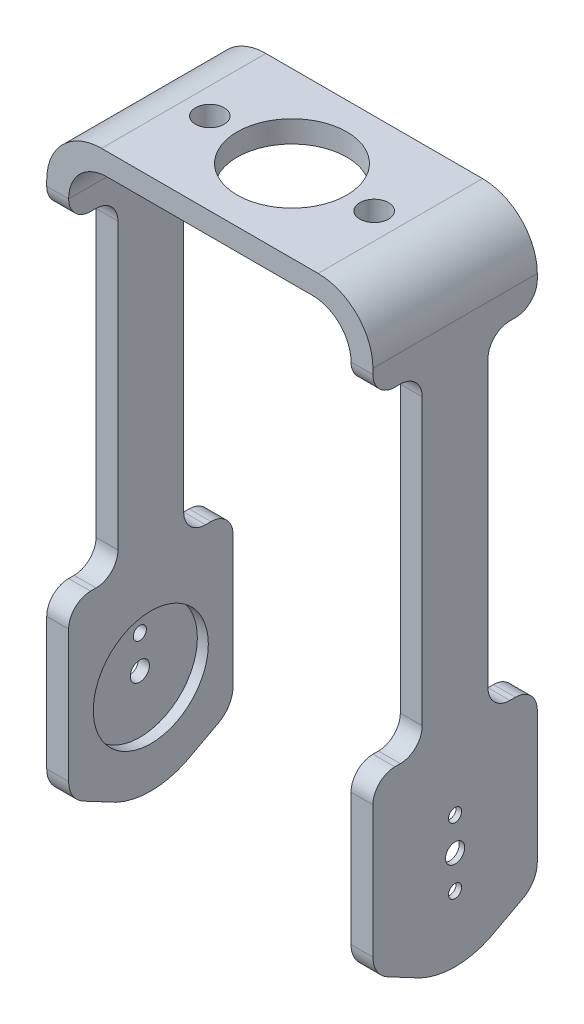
ISO-10303-21;
HEADER;
FILE_DESCRIPTION(('STEP AP214'),'2;1');
FILE_NAME('part.step','',(''),(''),'','','');
FILE_SCHEMA(('AUTOMOTIVE_DESIGN { 1 0 10303 214 1 1 1 1 }'));
ENDSEC;
DATA;
#1=APPLICATION_CONTEXT('core data for automotive mechanical design processes');
#2=APPLICATION_PROTOCOL_DEFINITION('international standard','automotive_design',2000,#1);
#3=PRODUCT_CONTEXT('',#1,'mechanical');
#4=PRODUCT('Part','Part','',(#3));
#5=PRODUCT_RELATED_PRODUCT_CATEGORY('part','',(#4));
#6=PRODUCT_DEFINITION_FORMATION('','',#4);
#7=PRODUCT_DEFINITION_CONTEXT('part definition',#1,'design');
#8=PRODUCT_DEFINITION('design','',#6,#7);
#9=PRODUCT_DEFINITION_SHAPE('','',#8);
#10=(LENGTH_UNIT() NAMED_UNIT(*) SI_UNIT(.MILLI.,.METRE.));
#11=(NAMED_UNIT(*) PLANE_ANGLE_UNIT() SI_UNIT($,.RADIAN.));
#12=(NAMED_UNIT(*) SI_UNIT($,.STERADIAN.) SOLID_ANGLE_UNIT());
#13=UNCERTAINTY_MEASURE_WITH_UNIT(LENGTH_MEASURE(1.E-05),#10,'distance_accuracy_value','');
#14=(GEOMETRIC_REPRESENTATION_CONTEXT(3) GLOBAL_UNCERTAINTY_ASSIGNED_CONTEXT((#13)) GLOBAL_UNIT_ASSIGNED_CONTEXT((#10,
#11,#12)) REPRESENTATION_CONTEXT('',''));
#15=CARTESIAN_POINT('',(0.,0.,0.));
#16=DIRECTION('',(0.,0.,1.));
#17=DIRECTION('',(1.,0.,0.));
#18=AXIS2_PLACEMENT_3D('',#15,#16,#17);
#19=CARTESIAN_POINT('',(0.,0.,-15.));
#20=DIRECTION('',(0.,0.,1.));
#21=DIRECTION('',(1.,0.,0.));
#22=AXIS2_PLACEMENT_3D('',#19,#20,#21);
#23=PLANE('',#22);
#24=DIRECTION('',(0.,1.,0.));
#25=VECTOR('',#24,1.);
#26=CARTESIAN_POINT('',(25.7740385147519,-24.3,-15.));
#27=LINE('',#26,#25);
#28=CARTESIAN_POINT('',(25.7740385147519,18.1173023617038,-15.));
#29=VERTEX_POINT('',#28);
#30=CARTESIAN_POINT('',(25.7740385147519,-5.99081256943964,-15.));
#31=VERTEX_POINT('',#30);
#32=EDGE_CURVE('E429',#29,#31,#27,.F.);
#33=ORIENTED_EDGE('',*,*,#32,.F.);
#34=DIRECTION('',(1.,0.,0.));
#35=VECTOR('',#34,1.);
#36=CARTESIAN_POINT('',(0.,18.1173023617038,-15.));
#37=LINE('',#36,#35);
#38=CARTESIAN_POINT('',(29.7740385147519,18.1173023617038,-15.));
#39=VERTEX_POINT('',#38);
#40=EDGE_CURVE('E649',#29,#39,#37,.T.);
#41=ORIENTED_EDGE('',*,*,#40,.T.);
#42=DIRECTION('',(0.,-1.,0.));
#43=VECTOR('',#42,1.);
#44=CARTESIAN_POINT('',(29.7740385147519,-24.3,-15.));
#45=LINE('',#44,#43);
#46=CARTESIAN_POINT('',(29.7740385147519,-5.99081256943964,-15.));
#47=VERTEX_POINT('',#46);
#48=EDGE_CURVE('E431',#39,#47,#45,.T.);
#49=ORIENTED_EDGE('',*,*,#48,.T.);
#50=DIRECTION('',(-1.,0.,0.));
#51=VECTOR('',#50,1.);
#52=CARTESIAN_POINT('',(25.7740385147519,-5.99081256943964,-15.));
#53=LINE('',#52,#51);
#54=EDGE_CURVE('E473',#47,#31,#53,.T.);
#55=ORIENTED_EDGE('',*,*,#54,.T.);
#56=EDGE_LOOP('',(#33,#41,#49,#55));
#57=FACE_BOUND('',#56,.T.);
#58=ADVANCED_FACE('F35',(#57),#23,.F.);
#59=DIRECTION('',(0.,1.,0.));
#60=VECTOR('',#59,1.);
#61=CARTESIAN_POINT('',(-29.7740385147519,-24.3,-15.));
#62=LINE('',#61,#60);
#63=CARTESIAN_POINT('',(-29.7740385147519,-5.99081256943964,-15.));
#64=VERTEX_POINT('',#63);
#65=CARTESIAN_POINT('',(-29.7740385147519,18.1173023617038,-15.));
#66=VERTEX_POINT('',#65);
#67=EDGE_CURVE('E439',#64,#66,#62,.T.);
#68=ORIENTED_EDGE('',*,*,#67,.T.);
#69=DIRECTION('',(1.,0.,0.));
#70=VECTOR('',#69,1.);
#71=CARTESIAN_POINT('',(0.,18.1173023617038,-15.));
#72=LINE('',#71,#70);
#73=CARTESIAN_POINT('',(-25.7740385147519,18.1173023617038,-15.));
#74=VERTEX_POINT('',#73);
#75=EDGE_CURVE('E642',#66,#74,#72,.T.);
#76=ORIENTED_EDGE('',*,*,#75,.T.);
#77=DIRECTION('',(0.,1.,0.));
#78=VECTOR('',#77,1.);
#79=CARTESIAN_POINT('',(-25.7740385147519,-24.3,-15.));
#80=LINE('',#79,#78);
#81=CARTESIAN_POINT('',(-25.7740385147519,-5.99081256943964,-15.));
#82=VERTEX_POINT('',#81);
#83=EDGE_CURVE('E442',#82,#74,#80,.T.);
#84=ORIENTED_EDGE('',*,*,#83,.F.);
#85=DIRECTION('',(-1.,0.,0.));
#86=VECTOR('',#85,1.);
#87=CARTESIAN_POINT('',(-29.7740385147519,-5.99081256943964,-15.));
#88=LINE('',#87,#86);
#89=EDGE_CURVE('E470',#82,#64,#88,.T.);
#90=ORIENTED_EDGE('',*,*,#89,.T.);
#91=EDGE_LOOP('',(#68,#76,#84,#90));
#92=FACE_BOUND('',#91,.T.);
#93=ADVANCED_FACE('F807',(#92),#23,.F.);
#94=CARTESIAN_POINT('',(0.,0.,15.));
#95=DIRECTION('',(0.,0.,1.));
#96=DIRECTION('',(1.,0.,0.));
#97=AXIS2_PLACEMENT_3D('',#94,#95,#96);
#98=PLANE('',#97);
#99=DIRECTION('',(0.,1.,0.));
#100=VECTOR('',#99,1.);
#101=CARTESIAN_POINT('',(-29.7740385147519,-24.3,15.));
#102=LINE('',#101,#100);
#103=CARTESIAN_POINT('',(-29.7740385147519,86.1173023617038,15.));
#104=VERTEX_POINT('',#103);
#105=CARTESIAN_POINT('',(-29.7740385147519,87.1173023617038,15.));
#106=VERTEX_POINT('',#105);
#107=EDGE_CURVE('E418',#104,#106,#102,.T.);
#108=ORIENTED_EDGE('',*,*,#107,.F.);
#109=DIRECTION('',(-1.,0.,0.));
#110=VECTOR('',#109,1.);
#111=CARTESIAN_POINT('',(-25.7740385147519,86.1173023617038,15.));
#112=LINE('',#111,#110);
#113=CARTESIAN_POINT('',(-25.7740385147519,86.1173023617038,15.));
#114=VERTEX_POINT('',#113);
#115=EDGE_CURVE('E612',#104,#114,#112,.F.);
#116=ORIENTED_EDGE('',*,*,#115,.T.);
#117=CARTESIAN_POINT('',(-18.7740385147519,86.1173023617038,15.));
#118=DIRECTION('',(0.,0.,1.));
#119=DIRECTION('',(1.,0.,0.));
#120=AXIS2_PLACEMENT_3D('',#117,#118,#119);
#121=CIRCLE('',#120,7.);
#122=CARTESIAN_POINT('',(-18.7740385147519,93.1173023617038,15.));
#123=VERTEX_POINT('',#122);
#124=EDGE_CURVE('E366',#114,#123,#121,.F.);
#125=ORIENTED_EDGE('',*,*,#124,.T.);
#126=DIRECTION('',(1.,0.,0.));
#127=VECTOR('',#126,1.);
#128=CARTESIAN_POINT('',(-29.7740385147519,93.1173023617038,15.));
#129=LINE('',#128,#127);
#130=CARTESIAN_POINT('',(18.7740385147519,93.1173023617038,15.));
#131=VERTEX_POINT('',#130);
#132=EDGE_CURVE('E425',#123,#131,#129,.T.);
#133=ORIENTED_EDGE('',*,*,#132,.T.);
#134=CARTESIAN_POINT('',(18.7740385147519,86.1173023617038,15.));
#135=DIRECTION('',(0.,0.,1.));
#136=DIRECTION('',(1.,0.,0.));
#137=AXIS2_PLACEMENT_3D('',#134,#135,#136);
#138=CIRCLE('',#137,7.);
#139=CARTESIAN_POINT('',(25.7740385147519,86.1173023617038,15.));
#140=VERTEX_POINT('',#139);
#141=EDGE_CURVE('E462',#131,#140,#138,.F.);
#142=ORIENTED_EDGE('',*,*,#141,.T.);
#143=DIRECTION('',(-1.,0.,0.));
#144=VECTOR('',#143,1.);
#145=CARTESIAN_POINT('',(29.7740385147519,86.1173023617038,15.));
#146=LINE('',#145,#144);
#147=CARTESIAN_POINT('',(29.7740385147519,86.1173023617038,15.));
#148=VERTEX_POINT('',#147);
#149=EDGE_CURVE('E610',#140,#148,#146,.F.);
#150=ORIENTED_EDGE('',*,*,#149,.T.);
#151=DIRECTION('',(0.,-1.,0.));
#152=VECTOR('',#151,1.);
#153=CARTESIAN_POINT('',(29.7740385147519,-24.3,15.));
#154=LINE('',#153,#152);
#155=CARTESIAN_POINT('',(29.7740385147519,87.1173023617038,15.));
#156=VERTEX_POINT('',#155);
#157=EDGE_CURVE('E412',#156,#148,#154,.T.);
#158=ORIENTED_EDGE('',*,*,#157,.F.);
#159=CARTESIAN_POINT('',(19.7740385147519,87.1173023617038,15.));
#160=DIRECTION('',(0.,0.,1.));
#161=DIRECTION('',(1.,0.,0.));
#162=AXIS2_PLACEMENT_3D('',#159,#160,#161);
#163=CIRCLE('',#162,10.);
#164=CARTESIAN_POINT('',(19.7740385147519,97.1173023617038,15.));
#165=VERTEX_POINT('',#164);
#166=EDGE_CURVE('E529',#156,#165,#163,.T.);
#167=ORIENTED_EDGE('',*,*,#166,.T.);
#168=DIRECTION('',(1.,0.,0.));
#169=VECTOR('',#168,1.);
#170=CARTESIAN_POINT('',(29.7740385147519,97.1173023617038,15.));
#171=LINE('',#170,#169);
#172=CARTESIAN_POINT('',(-19.7740385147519,97.1173023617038,15.));
#173=VERTEX_POINT('',#172);
#174=EDGE_CURVE('E415',#173,#165,#171,.T.);
#175=ORIENTED_EDGE('',*,*,#174,.F.);
#176=CARTESIAN_POINT('',(-19.7740385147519,87.1173023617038,15.));
#177=DIRECTION('',(0.,0.,1.));
#178=DIRECTION('',(1.,0.,0.));
#179=AXIS2_PLACEMENT_3D('',#176,#177,#178);
#180=CIRCLE('',#179,10.);
#181=EDGE_CURVE('E531',#173,#106,#180,.T.);
#182=ORIENTED_EDGE('',*,*,#181,.T.);
#183=EDGE_LOOP('',(#108,#116,#125,#133,#142,#150,#158,#167,#175,#182));
#184=FACE_BOUND('',#183,.T.);
#185=ADVANCED_FACE('F832',(#184),#98,.T.);
#186=DIRECTION('',(0.,1.,0.));
#187=VECTOR('',#186,1.);
#188=CARTESIAN_POINT('',(-25.7740385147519,-24.3,15.));
#189=LINE('',#188,#187);
#190=CARTESIAN_POINT('',(-25.7740385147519,-5.99081256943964,15.));
#191=VERTEX_POINT('',#190);
#192=CARTESIAN_POINT('',(-25.7740385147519,18.1173023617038,15.));
#193=VERTEX_POINT('',#192);
#194=EDGE_CURVE('E422',#191,#193,#189,.T.);
#195=ORIENTED_EDGE('',*,*,#194,.T.);
#196=DIRECTION('',(1.,0.,0.));
#197=VECTOR('',#196,1.);
#198=CARTESIAN_POINT('',(-29.7740385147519,18.1173023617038,15.));
#199=LINE('',#198,#197);
#200=CARTESIAN_POINT('',(-29.7740385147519,18.1173023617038,15.));
#201=VERTEX_POINT('',#200);
#202=EDGE_CURVE('E645',#193,#201,#199,.F.);
#203=ORIENTED_EDGE('',*,*,#202,.T.);
#204=CARTESIAN_POINT('',(-29.7740385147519,-5.99081256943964,15.));
#205=VERTEX_POINT('',#204);
#206=EDGE_CURVE('E419',#205,#201,#102,.T.);
#207=ORIENTED_EDGE('',*,*,#206,.F.);
#208=DIRECTION('',(-1.,0.,0.));
#209=VECTOR('',#208,1.);
#210=CARTESIAN_POINT('',(-25.7740385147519,-5.99081256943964,15.));
#211=LINE('',#210,#209);
#212=EDGE_CURVE('E500',#205,#191,#211,.F.);
#213=ORIENTED_EDGE('',*,*,#212,.T.);
#214=EDGE_LOOP('',(#195,#203,#207,#213));
#215=FACE_BOUND('',#214,.T.);
#216=ADVANCED_FACE('F849',(#215),#98,.T.);
#217=CARTESIAN_POINT('',(43.2259614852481,3.,0.));
#218=DIRECTION('',(-1.,0.,0.));
#219=DIRECTION('',(0.,0.,1.));
#220=AXIS2_PLACEMENT_3D('',#217,#218,#219);
#221=CYLINDRICAL_SURFACE('',#220,1.75);
#222=CARTESIAN_POINT('',(29.7740385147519,3.,0.));
#223=DIRECTION('',(1.,0.,0.));
#224=DIRECTION('',(0.,0.,-1.));
#225=AXIS2_PLACEMENT_3D('',#222,#223,#224);
#226=CIRCLE('',#225,1.75);
#227=CARTESIAN_POINT('',(29.7740385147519,3.,-1.75));
#228=VERTEX_POINT('',#227);
#229=EDGE_CURVE('E397',#228,#228,#226,.T.);
#230=ORIENTED_EDGE('',*,*,#229,.T.);
#231=EDGE_LOOP('',(#230));
#232=FACE_BOUND('',#231,.T.);
#233=CARTESIAN_POINT('',(28.7740385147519,3.,0.));
#234=DIRECTION('',(-1.,0.,0.));
#235=DIRECTION('',(0.,0.,1.));
#236=AXIS2_PLACEMENT_3D('',#233,#234,#235);
#237=CIRCLE('',#236,1.75);
#238=CARTESIAN_POINT('',(28.7740385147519,3.,1.75));
#239=VERTEX_POINT('',#238);
#240=EDGE_CURVE('E513',#239,#239,#237,.F.);
#241=ORIENTED_EDGE('',*,*,#240,.F.);
#242=EDGE_LOOP('',(#241));
#243=FACE_BOUND('',#242,.T.);
#244=ADVANCED_FACE('F1245',(#232,#243),#221,.F.);
#245=CARTESIAN_POINT('',(-29.7740385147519,3.,0.));
#246=DIRECTION('',(-1.,0.,0.));
#247=DIRECTION('',(0.,0.,1.));
#248=AXIS2_PLACEMENT_3D('',#245,#246,#247);
#249=CIRCLE('',#248,1.75);
#250=CARTESIAN_POINT('',(-29.7740385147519,3.,1.75));
#251=VERTEX_POINT('',#250);
#252=EDGE_CURVE('E394',#251,#251,#249,.T.);
#253=ORIENTED_EDGE('',*,*,#252,.T.);
#254=EDGE_LOOP('',(#253));
#255=FACE_BOUND('',#254,.T.);
#256=CARTESIAN_POINT('',(-27.7740385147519,3.,0.));
#257=DIRECTION('',(1.,0.,0.));
#258=DIRECTION('',(0.,0.,-1.));
#259=AXIS2_PLACEMENT_3D('',#256,#257,#258);
#260=CIRCLE('',#259,1.75);
#261=CARTESIAN_POINT('',(-27.7740385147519,3.,-1.75));
#262=VERTEX_POINT('',#261);
#263=EDGE_CURVE('E508',#262,#262,#260,.F.);
#264=ORIENTED_EDGE('',*,*,#263,.F.);
#265=EDGE_LOOP('',(#264));
#266=FACE_BOUND('',#265,.T.);
#267=ADVANCED_FACE('F1476',(#255,#266),#221,.F.);
#268=CARTESIAN_POINT('',(44.5049769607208,-13.2327844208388,-7.01165968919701));
#269=DIRECTION('',(0.,-0.883620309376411,-0.468204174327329));
#270=DIRECTION('',(0.,0.468204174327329,-0.883620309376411));
#271=AXIS2_PLACEMENT_3D('',#268,#269,#270);
#272=PLANE('',#271);
#273=DIRECTION('',(0.,-0.468204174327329,0.883620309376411));
#274=VECTOR('',#273,1.);
#275=CARTESIAN_POINT('',(25.7740385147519,-13.2327844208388,-7.01165968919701));
#276=LINE('',#275,#274);
#277=CARTESIAN_POINT('',(25.7740385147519,-10.4089141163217,-12.3410208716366));
#278=VERTEX_POINT('',#277);
#279=CARTESIAN_POINT('',(25.7740385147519,-12.8327383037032,-7.76664841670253));
#280=VERTEX_POINT('',#279);
#281=EDGE_CURVE('E783',#278,#280,#276,.T.);
#282=ORIENTED_EDGE('',*,*,#281,.F.);
#283=DIRECTION('',(-1.,0.,0.));
#284=VECTOR('',#283,1.);
#285=CARTESIAN_POINT('',(29.7740385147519,-10.4089141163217,-12.3410208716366));
#286=LINE('',#285,#284);
#287=CARTESIAN_POINT('',(29.7740385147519,-10.4089141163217,-12.3410208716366));
#288=VERTEX_POINT('',#287);
#289=EDGE_CURVE('E481',#278,#288,#286,.F.);
#290=ORIENTED_EDGE('',*,*,#289,.T.);
#291=DIRECTION('',(0.,-0.468204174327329,0.883620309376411));
#292=VECTOR('',#291,1.);
#293=CARTESIAN_POINT('',(29.7740385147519,-13.2327844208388,-7.01165968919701));
#294=LINE('',#293,#292);
#295=CARTESIAN_POINT('',(29.7740385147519,-12.8327383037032,-7.76664841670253));
#296=VERTEX_POINT('',#295);
#297=EDGE_CURVE('E791',#288,#296,#294,.T.);
#298=ORIENTED_EDGE('',*,*,#297,.T.);
#299=DIRECTION('',(-1.,0.,0.));
#300=VECTOR('',#299,1.);
#301=CARTESIAN_POINT('',(44.5049769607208,-12.8327383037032,-7.76664841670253));
#302=LINE('',#301,#300);
#303=EDGE_CURVE('E388',#296,#280,#302,.T.);
#304=ORIENTED_EDGE('',*,*,#303,.T.);
#305=EDGE_LOOP('',(#282,#290,#298,#304));
#306=FACE_BOUND('',#305,.T.);
#307=ADVANCED_FACE('F900',(#306),#272,.T.);
#308=CARTESIAN_POINT('',(44.5049769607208,-13.2327844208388,7.01165968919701));
#309=DIRECTION('',(0.,0.883620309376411,-0.468204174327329));
#310=DIRECTION('',(0.,0.468204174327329,0.883620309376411));
#311=AXIS2_PLACEMENT_3D('',#308,#309,#310);
#312=PLANE('',#311);
#313=DIRECTION('',(0.,-0.468204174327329,-0.883620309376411));
#314=VECTOR('',#313,1.);
#315=CARTESIAN_POINT('',(29.7740385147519,-13.2327844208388,7.01165968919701));
#316=LINE('',#315,#314);
#317=CARTESIAN_POINT('',(29.7740385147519,-10.4089141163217,12.3410208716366));
#318=VERTEX_POINT('',#317);
#319=CARTESIAN_POINT('',(29.7740385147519,-12.8327383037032,7.76664841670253));
#320=VERTEX_POINT('',#319);
#321=EDGE_CURVE('E786',#318,#320,#316,.T.);
#322=ORIENTED_EDGE('',*,*,#321,.F.);
#323=DIRECTION('',(-1.,0.,0.));
#324=VECTOR('',#323,1.);
#325=CARTESIAN_POINT('',(25.7740385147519,-10.4089141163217,12.3410208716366));
#326=LINE('',#325,#324);
#327=CARTESIAN_POINT('',(25.7740385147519,-10.4089141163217,12.3410208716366));
#328=VERTEX_POINT('',#327);
#329=EDGE_CURVE('E497',#318,#328,#326,.T.);
#330=ORIENTED_EDGE('',*,*,#329,.T.);
#331=DIRECTION('',(0.,-0.468204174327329,-0.883620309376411));
#332=VECTOR('',#331,1.);
#333=CARTESIAN_POINT('',(25.7740385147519,-13.2327844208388,7.01165968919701));
#334=LINE('',#333,#332);
#335=CARTESIAN_POINT('',(25.7740385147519,-12.8327383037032,7.76664841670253));
#336=VERTEX_POINT('',#335);
#337=EDGE_CURVE('E365',#328,#336,#334,.T.);
#338=ORIENTED_EDGE('',*,*,#337,.T.);
#339=DIRECTION('',(-1.,0.,0.));
#340=VECTOR('',#339,1.);
#341=CARTESIAN_POINT('',(44.5049769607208,-12.8327383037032,7.76664841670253));
#342=LINE('',#341,#340);
#343=EDGE_CURVE('E376',#320,#336,#342,.T.);
#344=ORIENTED_EDGE('',*,*,#343,.F.);
#345=EDGE_LOOP('',(#322,#330,#338,#344));
#346=FACE_BOUND('',#345,.T.);
#347=ADVANCED_FACE('F913',(#346),#312,.F.);
#348=CARTESIAN_POINT('',(50.2259614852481,0.,0.));
#349=DIRECTION('',(-1.,0.,0.));
#350=DIRECTION('',(0.,0.,1.));
#351=AXIS2_PLACEMENT_3D('',#348,#349,#350);
#352=CYLINDRICAL_SURFACE('',#351,15.);
#353=CARTESIAN_POINT('',(-25.7740385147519,0.,0.));
#354=DIRECTION('',(-1.,0.,0.));
#355=DIRECTION('',(0.,0.,1.));
#356=AXIS2_PLACEMENT_3D('',#353,#354,#355);
#357=CIRCLE('',#356,15.);
#358=CARTESIAN_POINT('',(-25.7740385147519,-12.8327383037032,-7.76664841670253));
#359=VERTEX_POINT('',#358);
#360=CARTESIAN_POINT('',(-25.7740385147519,-12.8327383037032,7.76664841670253));
#361=VERTEX_POINT('',#360);
#362=EDGE_CURVE('E358',#359,#361,#357,.T.);
#363=ORIENTED_EDGE('',*,*,#362,.T.);
#364=CARTESIAN_POINT('',(-29.7740385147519,-12.8327383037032,7.76664841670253));
#365=VERTEX_POINT('',#364);
#366=EDGE_CURVE('E369',#361,#365,#342,.T.);
#367=ORIENTED_EDGE('',*,*,#366,.T.);
#368=CARTESIAN_POINT('',(-29.7740385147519,0.,0.));
#369=DIRECTION('',(-1.,0.,0.));
#370=DIRECTION('',(0.,0.,1.));
#371=AXIS2_PLACEMENT_3D('',#368,#369,#370);
#372=CIRCLE('',#371,15.);
#373=CARTESIAN_POINT('',(-29.7740385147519,-12.8327383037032,-7.76664841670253));
#374=VERTEX_POINT('',#373);
#375=EDGE_CURVE('E383',#374,#365,#372,.T.);
#376=ORIENTED_EDGE('',*,*,#375,.F.);
#377=EDGE_CURVE('E381',#359,#374,#302,.T.);
#378=ORIENTED_EDGE('',*,*,#377,.F.);
#379=EDGE_LOOP('',(#363,#367,#376,#378));
#380=FACE_BOUND('',#379,.T.);
#381=ADVANCED_FACE('F379',(#380),#352,.T.);
#382=CARTESIAN_POINT('',(29.7740385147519,0.,0.));
#383=DIRECTION('',(1.,0.,0.));
#384=DIRECTION('',(0.,0.,-1.));
#385=AXIS2_PLACEMENT_3D('',#382,#383,#384);
#386=CIRCLE('',#385,15.);
#387=EDGE_CURVE('E382',#320,#296,#386,.T.);
#388=ORIENTED_EDGE('',*,*,#387,.F.);
#389=ORIENTED_EDGE('',*,*,#343,.T.);
#390=CARTESIAN_POINT('',(25.7740385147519,0.,0.));
#391=DIRECTION('',(1.,0.,0.));
#392=DIRECTION('',(0.,0.,-1.));
#393=AXIS2_PLACEMENT_3D('',#390,#391,#392);
#394=CIRCLE('',#393,15.);
#395=EDGE_CURVE('E386',#336,#280,#394,.T.);
#396=ORIENTED_EDGE('',*,*,#395,.T.);
#397=ORIENTED_EDGE('',*,*,#303,.F.);
#398=EDGE_LOOP('',(#388,#389,#396,#397));
#399=FACE_BOUND('',#398,.T.);
#400=ADVANCED_FACE('F908',(#399),#352,.T.);
#401=CARTESIAN_POINT('',(25.7740385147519,-24.3,15.));
#402=DIRECTION('',(1.,0.,0.));
#403=DIRECTION('',(0.,0.,-1.));
#404=AXIS2_PLACEMENT_3D('',#401,#402,#403);
#405=PLANE('',#404);
#406=CARTESIAN_POINT('',(25.7740385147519,3.,0.));
#407=DIRECTION('',(-1.,0.,0.));
#408=DIRECTION('',(0.,0.,1.));
#409=AXIS2_PLACEMENT_3D('',#406,#407,#408);
#410=CIRCLE('',#409,11.5);
#411=CARTESIAN_POINT('',(25.7740385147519,3.,11.5));
#412=VERTEX_POINT('',#411);
#413=EDGE_CURVE('E773',#412,#412,#410,.T.);
#414=ORIENTED_EDGE('',*,*,#413,.F.);
#415=EDGE_LOOP('',(#414));
#416=FACE_BOUND('',#415,.T.);
#417=DIRECTION('',(0.,0.,1.));
#418=VECTOR('',#417,1.);
#419=CARTESIAN_POINT('',(25.7740385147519,82.1173023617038,15.));
#420=LINE('',#419,#418);
#421=CARTESIAN_POINT('',(25.7740385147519,82.1173023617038,10.));
#422=VERTEX_POINT('',#421);
#423=CARTESIAN_POINT('',(25.7740385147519,82.1173023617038,11.));
#424=VERTEX_POINT('',#423);
#425=EDGE_CURVE('E740',#422,#424,#420,.T.);
#426=ORIENTED_EDGE('',*,*,#425,.T.);
#427=CARTESIAN_POINT('',(25.7740385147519,86.1173023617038,11.));
#428=DIRECTION('',(1.,0.,0.));
#429=DIRECTION('',(0.,0.,-1.));
#430=AXIS2_PLACEMENT_3D('',#427,#428,#429);
#431=CIRCLE('',#430,4.);
#432=EDGE_CURVE('E628',#424,#140,#431,.F.);
#433=ORIENTED_EDGE('',*,*,#432,.T.);
#434=DIRECTION('',(0.,0.,-1.));
#435=VECTOR('',#434,1.);
#436=CARTESIAN_POINT('',(25.7740385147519,86.1173023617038,-15.));
#437=LINE('',#436,#435);
#438=CARTESIAN_POINT('',(25.7740385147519,86.1173023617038,-15.));
#439=VERTEX_POINT('',#438);
#440=EDGE_CURVE('E428',#140,#439,#437,.T.);
#441=ORIENTED_EDGE('',*,*,#440,.T.);
#442=CARTESIAN_POINT('',(25.7740385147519,86.1173023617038,-11.));
#443=DIRECTION('',(1.,0.,0.));
#444=DIRECTION('',(0.,0.,-1.));
#445=AXIS2_PLACEMENT_3D('',#442,#443,#444);
#446=CIRCLE('',#445,4.);
#447=CARTESIAN_POINT('',(25.7740385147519,82.1173023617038,-11.));
#448=VERTEX_POINT('',#447);
#449=EDGE_CURVE('E626',#439,#448,#446,.F.);
#450=ORIENTED_EDGE('',*,*,#449,.T.);
#451=DIRECTION('',(0.,0.,1.));
#452=VECTOR('',#451,1.);
#453=CARTESIAN_POINT('',(25.7740385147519,82.1173023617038,15.));
#454=LINE('',#453,#452);
#455=CARTESIAN_POINT('',(25.7740385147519,82.1173023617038,-10.));
#456=VERTEX_POINT('',#455);
#457=EDGE_CURVE('E708',#448,#456,#454,.T.);
#458=ORIENTED_EDGE('',*,*,#457,.T.);
#459=CARTESIAN_POINT('',(25.7740385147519,78.1173023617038,-10.));
#460=DIRECTION('',(1.,0.,0.));
#461=DIRECTION('',(0.,0.,-1.));
#462=AXIS2_PLACEMENT_3D('',#459,#460,#461);
#463=CIRCLE('',#462,4.);
#464=CARTESIAN_POINT('',(25.7740385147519,78.1173023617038,-6.));
#465=VERTEX_POINT('',#464);
#466=EDGE_CURVE('E653',#456,#465,#463,.T.);
#467=ORIENTED_EDGE('',*,*,#466,.T.);
#468=DIRECTION('',(0.,-1.,0.));
#469=VECTOR('',#468,1.);
#470=CARTESIAN_POINT('',(25.7740385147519,-24.3,-6.00000000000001));
#471=LINE('',#470,#469);
#472=CARTESIAN_POINT('',(25.7740385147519,26.1173023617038,-6.00000000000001));
#473=VERTEX_POINT('',#472);
#474=EDGE_CURVE('E713',#465,#473,#471,.T.);
#475=ORIENTED_EDGE('',*,*,#474,.T.);
#476=CARTESIAN_POINT('',(25.7740385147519,26.1173023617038,-10.));
#477=DIRECTION('',(1.,0.,0.));
#478=DIRECTION('',(0.,0.,-1.));
#479=AXIS2_PLACEMENT_3D('',#476,#477,#478);
#480=CIRCLE('',#479,4.);
#481=CARTESIAN_POINT('',(25.7740385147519,22.1173023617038,-10.));
#482=VERTEX_POINT('',#481);
#483=EDGE_CURVE('E661',#473,#482,#480,.T.);
#484=ORIENTED_EDGE('',*,*,#483,.T.);
#485=DIRECTION('',(0.,0.,-1.));
#486=VECTOR('',#485,1.);
#487=CARTESIAN_POINT('',(25.7740385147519,22.1173023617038,15.));
#488=LINE('',#487,#486);
#489=CARTESIAN_POINT('',(25.7740385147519,22.1173023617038,-11.));
#490=VERTEX_POINT('',#489);
#491=EDGE_CURVE('E704',#482,#490,#488,.T.);
#492=ORIENTED_EDGE('',*,*,#491,.T.);
#493=CARTESIAN_POINT('',(25.7740385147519,18.1173023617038,-11.));
#494=DIRECTION('',(1.,0.,0.));
#495=DIRECTION('',(0.,0.,-1.));
#496=AXIS2_PLACEMENT_3D('',#493,#494,#495);
#497=CIRCLE('',#496,4.);
#498=EDGE_CURVE('E622',#490,#29,#497,.F.);
#499=ORIENTED_EDGE('',*,*,#498,.T.);
#500=ORIENTED_EDGE('',*,*,#32,.T.);
#501=CARTESIAN_POINT('',(25.7740385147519,-5.99081256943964,-10.));
#502=DIRECTION('',(1.,0.,0.));
#503=DIRECTION('',(0.,0.,-1.));
#504=AXIS2_PLACEMENT_3D('',#501,#502,#503);
#505=CIRCLE('',#504,5.);
#506=EDGE_CURVE('E479',#31,#278,#505,.F.);
#507=ORIENTED_EDGE('',*,*,#506,.T.);
#508=ORIENTED_EDGE('',*,*,#281,.T.);
#509=ORIENTED_EDGE('',*,*,#395,.F.);
#510=ORIENTED_EDGE('',*,*,#337,.F.);
#511=CARTESIAN_POINT('',(25.7740385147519,-5.99081256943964,10.));
#512=DIRECTION('',(1.,0.,0.));
#513=DIRECTION('',(0.,0.,-1.));
#514=AXIS2_PLACEMENT_3D('',#511,#512,#513);
#515=CIRCLE('',#514,5.);
#516=CARTESIAN_POINT('',(25.7740385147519,-5.99081256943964,15.));
#517=VERTEX_POINT('',#516);
#518=EDGE_CURVE('E476',#328,#517,#515,.F.);
#519=ORIENTED_EDGE('',*,*,#518,.T.);
#520=DIRECTION('',(0.,1.,0.));
#521=VECTOR('',#520,1.);
#522=CARTESIAN_POINT('',(25.7740385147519,-24.3,15.));
#523=LINE('',#522,#521);
#524=CARTESIAN_POINT('',(25.7740385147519,18.1173023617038,15.));
#525=VERTEX_POINT('',#524);
#526=EDGE_CURVE('E408',#525,#517,#523,.F.);
#527=ORIENTED_EDGE('',*,*,#526,.F.);
#528=CARTESIAN_POINT('',(25.7740385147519,18.1173023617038,11.));
#529=DIRECTION('',(1.,0.,0.));
#530=DIRECTION('',(0.,0.,-1.));
#531=AXIS2_PLACEMENT_3D('',#528,#529,#530);
#532=CIRCLE('',#531,4.);
#533=CARTESIAN_POINT('',(25.7740385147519,22.1173023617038,11.));
#534=VERTEX_POINT('',#533);
#535=EDGE_CURVE('E624',#525,#534,#532,.F.);
#536=ORIENTED_EDGE('',*,*,#535,.T.);
#537=DIRECTION('',(0.,0.,-1.));
#538=VECTOR('',#537,1.);
#539=CARTESIAN_POINT('',(25.7740385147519,22.1173023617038,15.));
#540=LINE('',#539,#538);
#541=CARTESIAN_POINT('',(25.7740385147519,22.1173023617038,9.99999999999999));
#542=VERTEX_POINT('',#541);
#543=EDGE_CURVE('E731',#534,#542,#540,.T.);
#544=ORIENTED_EDGE('',*,*,#543,.T.);
#545=CARTESIAN_POINT('',(25.7740385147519,26.1173023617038,9.99999999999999));
#546=DIRECTION('',(1.,0.,0.));
#547=DIRECTION('',(0.,0.,-1.));
#548=AXIS2_PLACEMENT_3D('',#545,#546,#547);
#549=CIRCLE('',#548,4.);
#550=CARTESIAN_POINT('',(25.7740385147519,26.1173023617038,5.99999999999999));
#551=VERTEX_POINT('',#550);
#552=EDGE_CURVE('E665',#542,#551,#549,.T.);
#553=ORIENTED_EDGE('',*,*,#552,.T.);
#554=DIRECTION('',(0.,1.,0.));
#555=VECTOR('',#554,1.);
#556=CARTESIAN_POINT('',(25.7740385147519,-24.3,5.99999999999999));
#557=LINE('',#556,#555);
#558=CARTESIAN_POINT('',(25.7740385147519,78.1173023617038,6.));
#559=VERTEX_POINT('',#558);
#560=EDGE_CURVE('E746',#551,#559,#557,.T.);
#561=ORIENTED_EDGE('',*,*,#560,.T.);
#562=CARTESIAN_POINT('',(25.7740385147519,78.1173023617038,10.));
#563=DIRECTION('',(1.,0.,0.));
#564=DIRECTION('',(0.,0.,-1.));
#565=AXIS2_PLACEMENT_3D('',#562,#563,#564);
#566=CIRCLE('',#565,4.);
#567=EDGE_CURVE('E673',#559,#422,#566,.T.);
#568=ORIENTED_EDGE('',*,*,#567,.T.);
#569=EDGE_LOOP('',(#426,#433,#441,#450,#458,#467,#475,#484,#492,#499,#500,#507,#508,#509,#510,
#519,#527,#536,#544,#553,#561,#568));
#570=FACE_BOUND('',#569,.T.);
#571=ADVANCED_FACE('F891',(#416,#570),#405,.F.);
#572=CARTESIAN_POINT('',(29.7740385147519,-24.3,15.));
#573=DIRECTION('',(1.,0.,0.));
#574=DIRECTION('',(0.,0.,-1.));
#575=AXIS2_PLACEMENT_3D('',#572,#573,#574);
#576=PLANE('',#575);
#577=ORIENTED_EDGE('',*,*,#157,.T.);
#578=CARTESIAN_POINT('',(29.7740385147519,86.1173023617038,11.));
#579=DIRECTION('',(1.,0.,0.));
#580=DIRECTION('',(0.,0.,-1.));
#581=AXIS2_PLACEMENT_3D('',#578,#579,#580);
#582=CIRCLE('',#581,4.);
#583=CARTESIAN_POINT('',(29.7740385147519,82.1173023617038,11.));
#584=VERTEX_POINT('',#583);
#585=EDGE_CURVE('E634',#148,#584,#582,.T.);
#586=ORIENTED_EDGE('',*,*,#585,.T.);
#587=DIRECTION('',(0.,0.,1.));
#588=VECTOR('',#587,1.);
#589=CARTESIAN_POINT('',(29.7740385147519,82.1173023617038,15.));
#590=LINE('',#589,#588);
#591=CARTESIAN_POINT('',(29.7740385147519,82.1173023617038,10.));
#592=VERTEX_POINT('',#591);
#593=EDGE_CURVE('E722',#592,#584,#590,.T.);
#594=ORIENTED_EDGE('',*,*,#593,.F.);
#595=CARTESIAN_POINT('',(29.7740385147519,78.1173023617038,10.));
#596=DIRECTION('',(1.,0.,0.));
#597=DIRECTION('',(0.,0.,-1.));
#598=AXIS2_PLACEMENT_3D('',#595,#596,#597);
#599=CIRCLE('',#598,4.);
#600=CARTESIAN_POINT('',(29.7740385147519,78.1173023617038,6.));
#601=VERTEX_POINT('',#600);
#602=EDGE_CURVE('E671',#592,#601,#599,.F.);
#603=ORIENTED_EDGE('',*,*,#602,.T.);
#604=DIRECTION('',(0.,1.,0.));
#605=VECTOR('',#604,1.);
#606=CARTESIAN_POINT('',(29.7740385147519,82.1173023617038,6.));
#607=LINE('',#606,#605);
#608=CARTESIAN_POINT('',(29.7740385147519,26.1173023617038,5.99999999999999));
#609=VERTEX_POINT('',#608);
#610=EDGE_CURVE('E719',#609,#601,#607,.T.);
#611=ORIENTED_EDGE('',*,*,#610,.F.);
#612=CARTESIAN_POINT('',(29.7740385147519,26.1173023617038,9.99999999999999));
#613=DIRECTION('',(1.,0.,0.));
#614=DIRECTION('',(0.,0.,-1.));
#615=AXIS2_PLACEMENT_3D('',#612,#613,#614);
#616=CIRCLE('',#615,4.);
#617=CARTESIAN_POINT('',(29.7740385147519,22.1173023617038,9.99999999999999));
#618=VERTEX_POINT('',#617);
#619=EDGE_CURVE('E663',#609,#618,#616,.F.);
#620=ORIENTED_EDGE('',*,*,#619,.T.);
#621=DIRECTION('',(0.,0.,-1.));
#622=VECTOR('',#621,1.);
#623=CARTESIAN_POINT('',(29.7740385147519,22.1173023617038,5.99999999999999));
#624=LINE('',#623,#622);
#625=CARTESIAN_POINT('',(29.7740385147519,22.1173023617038,11.));
#626=VERTEX_POINT('',#625);
#627=EDGE_CURVE('E716',#626,#618,#624,.T.);
#628=ORIENTED_EDGE('',*,*,#627,.F.);
#629=CARTESIAN_POINT('',(29.7740385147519,18.1173023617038,11.));
#630=DIRECTION('',(1.,0.,0.));
#631=DIRECTION('',(0.,0.,-1.));
#632=AXIS2_PLACEMENT_3D('',#629,#630,#631);
#633=CIRCLE('',#632,4.);
#634=CARTESIAN_POINT('',(29.7740385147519,18.1173023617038,15.));
#635=VERTEX_POINT('',#634);
#636=EDGE_CURVE('E58',#626,#635,#633,.T.);
#637=ORIENTED_EDGE('',*,*,#636,.T.);
#638=CARTESIAN_POINT('',(29.7740385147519,-5.99081256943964,15.));
#639=VERTEX_POINT('',#638);
#640=EDGE_CURVE('E410',#635,#639,#154,.T.);
#641=ORIENTED_EDGE('',*,*,#640,.T.);
#642=CARTESIAN_POINT('',(29.7740385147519,-5.99081256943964,10.));
#643=DIRECTION('',(1.,0.,0.));
#644=DIRECTION('',(0.,0.,-1.));
#645=AXIS2_PLACEMENT_3D('',#642,#643,#644);
#646=CIRCLE('',#645,5.);
#647=EDGE_CURVE('E483',#639,#318,#646,.T.);
#648=ORIENTED_EDGE('',*,*,#647,.T.);
#649=ORIENTED_EDGE('',*,*,#321,.T.);
#650=ORIENTED_EDGE('',*,*,#387,.T.);
#651=ORIENTED_EDGE('',*,*,#297,.F.);
#652=CARTESIAN_POINT('',(29.7740385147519,-5.99081256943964,-10.));
#653=DIRECTION('',(1.,0.,0.));
#654=DIRECTION('',(0.,0.,-1.));
#655=AXIS2_PLACEMENT_3D('',#652,#653,#654);
#656=CIRCLE('',#655,5.);
#657=EDGE_CURVE('E485',#288,#47,#656,.T.);
#658=ORIENTED_EDGE('',*,*,#657,.T.);
#659=ORIENTED_EDGE('',*,*,#48,.F.);
#660=CARTESIAN_POINT('',(29.7740385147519,18.1173023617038,-11.));
#661=DIRECTION('',(1.,0.,0.));
#662=DIRECTION('',(0.,0.,-1.));
#663=AXIS2_PLACEMENT_3D('',#660,#661,#662);
#664=CIRCLE('',#663,4.);
#665=CARTESIAN_POINT('',(29.7740385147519,22.1173023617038,-11.));
#666=VERTEX_POINT('',#665);
#667=EDGE_CURVE('E50',#39,#666,#664,.T.);
#668=ORIENTED_EDGE('',*,*,#667,.T.);
#669=DIRECTION('',(0.,0.,-1.));
#670=VECTOR('',#669,1.);
#671=CARTESIAN_POINT('',(29.7740385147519,22.1173023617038,-6.00000000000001));
#672=LINE('',#671,#670);
#673=CARTESIAN_POINT('',(29.7740385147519,22.1173023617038,-10.));
#674=VERTEX_POINT('',#673);
#675=EDGE_CURVE('E882',#674,#666,#672,.T.);
#676=ORIENTED_EDGE('',*,*,#675,.F.);
#677=CARTESIAN_POINT('',(29.7740385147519,26.1173023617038,-10.));
#678=DIRECTION('',(1.,0.,0.));
#679=DIRECTION('',(0.,0.,-1.));
#680=AXIS2_PLACEMENT_3D('',#677,#678,#679);
#681=CIRCLE('',#680,4.);
#682=CARTESIAN_POINT('',(29.7740385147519,26.1173023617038,-6.));
#683=VERTEX_POINT('',#682);
#684=EDGE_CURVE('E659',#674,#683,#681,.F.);
#685=ORIENTED_EDGE('',*,*,#684,.T.);
#686=DIRECTION('',(0.,-1.,0.));
#687=VECTOR('',#686,1.);
#688=CARTESIAN_POINT('',(29.7740385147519,82.1173023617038,-6.));
#689=LINE('',#688,#687);
#690=CARTESIAN_POINT('',(29.7740385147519,78.1173023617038,-6.));
#691=VERTEX_POINT('',#690);
#692=EDGE_CURVE('E874',#691,#683,#689,.T.);
#693=ORIENTED_EDGE('',*,*,#692,.F.);
#694=CARTESIAN_POINT('',(29.7740385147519,78.1173023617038,-10.));
#695=DIRECTION('',(1.,0.,0.));
#696=DIRECTION('',(0.,0.,-1.));
#697=AXIS2_PLACEMENT_3D('',#694,#695,#696);
#698=CIRCLE('',#697,4.);
#699=CARTESIAN_POINT('',(29.7740385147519,82.1173023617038,-10.));
#700=VERTEX_POINT('',#699);
#701=EDGE_CURVE('E651',#691,#700,#698,.F.);
#702=ORIENTED_EDGE('',*,*,#701,.T.);
#703=DIRECTION('',(0.,0.,1.));
#704=VECTOR('',#703,1.);
#705=CARTESIAN_POINT('',(29.7740385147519,82.1173023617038,-15.));
#706=LINE('',#705,#704);
#707=CARTESIAN_POINT('',(29.7740385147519,82.1173023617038,-11.));
#708=VERTEX_POINT('',#707);
#709=EDGE_CURVE('E879',#708,#700,#706,.T.);
#710=ORIENTED_EDGE('',*,*,#709,.F.);
#711=CARTESIAN_POINT('',(29.7740385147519,86.1173023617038,-11.));
#712=DIRECTION('',(1.,0.,0.));
#713=DIRECTION('',(0.,0.,-1.));
#714=AXIS2_PLACEMENT_3D('',#711,#712,#713);
#715=CIRCLE('',#714,4.);
#716=CARTESIAN_POINT('',(29.7740385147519,86.1173023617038,-15.));
#717=VERTEX_POINT('',#716);
#718=EDGE_CURVE('E632',#708,#717,#715,.T.);
#719=ORIENTED_EDGE('',*,*,#718,.T.);
#720=CARTESIAN_POINT('',(29.7740385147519,87.1173023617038,-15.));
#721=VERTEX_POINT('',#720);
#722=EDGE_CURVE('E432',#721,#717,#45,.T.);
#723=ORIENTED_EDGE('',*,*,#722,.F.);
#724=DIRECTION('',(0.,0.,-1.));
#725=VECTOR('',#724,1.);
#726=CARTESIAN_POINT('',(29.7740385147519,87.1173023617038,15.));
#727=LINE('',#726,#725);
#728=EDGE_CURVE('E534',#721,#156,#727,.F.);
#729=ORIENTED_EDGE('',*,*,#728,.T.);
#730=EDGE_LOOP('',(#577,#586,#594,#603,#611,#620,#628,#637,#641,#648,#649,#650,#651,#658,#659,
#668,#676,#685,#693,#702,#710,#719,#723,#729));
#731=FACE_BOUND('',#730,.T.);
#732=CARTESIAN_POINT('',(29.7740385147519,-3.,0.));
#733=DIRECTION('',(1.,0.,0.));
#734=DIRECTION('',(0.,0.,-1.));
#735=AXIS2_PLACEMENT_3D('',#732,#733,#734);
#736=CIRCLE('',#735,1.2);
#737=CARTESIAN_POINT('',(29.7740385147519,-3.,-1.2));
#738=VERTEX_POINT('',#737);
#739=EDGE_CURVE('E764',#738,#738,#736,.T.);
#740=ORIENTED_EDGE('',*,*,#739,.F.);
#741=EDGE_LOOP('',(#740));
#742=FACE_BOUND('',#741,.T.);
#743=CARTESIAN_POINT('',(29.7740385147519,9.,0.));
#744=DIRECTION('',(1.,0.,0.));
#745=DIRECTION('',(0.,0.,-1.));
#746=AXIS2_PLACEMENT_3D('',#743,#744,#745);
#747=CIRCLE('',#746,1.2);
#748=CARTESIAN_POINT('',(29.7740385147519,9.,-1.2));
#749=VERTEX_POINT('',#748);
#750=EDGE_CURVE('E770',#749,#749,#747,.T.);
#751=ORIENTED_EDGE('',*,*,#750,.F.);
#752=EDGE_LOOP('',(#751));
#753=FACE_BOUND('',#752,.T.);
#754=ORIENTED_EDGE('',*,*,#229,.F.);
#755=EDGE_LOOP('',(#754));
#756=FACE_BOUND('',#755,.T.);
#757=ADVANCED_FACE('F902',(#731,#742,#753,#756),#576,.T.);
#758=CARTESIAN_POINT('',(-29.7740385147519,-24.3,15.));
#759=DIRECTION('',(-1.,0.,0.));
#760=DIRECTION('',(0.,0.,1.));
#761=AXIS2_PLACEMENT_3D('',#758,#759,#760);
#762=PLANE('',#761);
#763=DIRECTION('',(0.,0.,-1.));
#764=VECTOR('',#763,1.);
#765=CARTESIAN_POINT('',(-29.7740385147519,82.1173023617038,15.));
#766=LINE('',#765,#764);
#767=CARTESIAN_POINT('',(-29.7740385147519,82.1173023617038,11.));
#768=VERTEX_POINT('',#767);
#769=CARTESIAN_POINT('',(-29.7740385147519,82.1173023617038,10.));
#770=VERTEX_POINT('',#769);
#771=EDGE_CURVE('E737',#768,#770,#766,.T.);
#772=ORIENTED_EDGE('',*,*,#771,.F.);
#773=CARTESIAN_POINT('',(-29.7740385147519,86.1173023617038,11.));
#774=DIRECTION('',(-1.,0.,0.));
#775=DIRECTION('',(0.,0.,1.));
#776=AXIS2_PLACEMENT_3D('',#773,#774,#775);
#777=CIRCLE('',#776,4.);
#778=EDGE_CURVE('E608',#768,#104,#777,.T.);
#779=ORIENTED_EDGE('',*,*,#778,.T.);
#780=ORIENTED_EDGE('',*,*,#107,.T.);
#781=DIRECTION('',(0.,0.,-1.));
#782=VECTOR('',#781,1.);
#783=CARTESIAN_POINT('',(-29.7740385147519,87.1173023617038,15.));
#784=LINE('',#783,#782);
#785=CARTESIAN_POINT('',(-29.7740385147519,87.1173023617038,-15.));
#786=VERTEX_POINT('',#785);
#787=EDGE_CURVE('E507',#106,#786,#784,.T.);
#788=ORIENTED_EDGE('',*,*,#787,.T.);
#789=CARTESIAN_POINT('',(-29.7740385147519,86.1173023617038,-15.));
#790=VERTEX_POINT('',#789);
#791=EDGE_CURVE('E438',#790,#786,#62,.T.);
#792=ORIENTED_EDGE('',*,*,#791,.F.);
#793=CARTESIAN_POINT('',(-29.7740385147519,86.1173023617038,-11.));
#794=DIRECTION('',(-1.,0.,0.));
#795=DIRECTION('',(0.,0.,1.));
#796=AXIS2_PLACEMENT_3D('',#793,#794,#795);
#797=CIRCLE('',#796,4.);
#798=CARTESIAN_POINT('',(-29.7740385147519,82.1173023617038,-11.));
#799=VERTEX_POINT('',#798);
#800=EDGE_CURVE('E606',#790,#799,#797,.T.);
#801=ORIENTED_EDGE('',*,*,#800,.T.);
#802=DIRECTION('',(0.,0.,-1.));
#803=VECTOR('',#802,1.);
#804=CARTESIAN_POINT('',(-29.7740385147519,82.1173023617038,15.));
#805=LINE('',#804,#803);
#806=CARTESIAN_POINT('',(-29.7740385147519,82.1173023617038,-10.));
#807=VERTEX_POINT('',#806);
#808=EDGE_CURVE('E864',#807,#799,#805,.T.);
#809=ORIENTED_EDGE('',*,*,#808,.F.);
#810=CARTESIAN_POINT('',(-29.7740385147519,78.1173023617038,-10.));
#811=DIRECTION('',(-1.,0.,0.));
#812=DIRECTION('',(0.,0.,1.));
#813=AXIS2_PLACEMENT_3D('',#810,#811,#812);
#814=CIRCLE('',#813,4.);
#815=CARTESIAN_POINT('',(-29.7740385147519,78.1173023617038,-6.));
#816=VERTEX_POINT('',#815);
#817=EDGE_CURVE('E657',#807,#816,#814,.F.);
#818=ORIENTED_EDGE('',*,*,#817,.T.);
#819=DIRECTION('',(0.,1.,0.));
#820=VECTOR('',#819,1.);
#821=CARTESIAN_POINT('',(-29.7740385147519,-24.3,-6.00000000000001));
#822=LINE('',#821,#820);
#823=CARTESIAN_POINT('',(-29.7740385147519,26.1173023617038,-6.00000000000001));
#824=VERTEX_POINT('',#823);
#825=EDGE_CURVE('E700',#824,#816,#822,.T.);
#826=ORIENTED_EDGE('',*,*,#825,.F.);
#827=CARTESIAN_POINT('',(-29.7740385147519,26.1173023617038,-10.));
#828=DIRECTION('',(-1.,0.,0.));
#829=DIRECTION('',(0.,0.,1.));
#830=AXIS2_PLACEMENT_3D('',#827,#828,#829);
#831=CIRCLE('',#830,4.);
#832=CARTESIAN_POINT('',(-29.7740385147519,22.1173023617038,-10.));
#833=VERTEX_POINT('',#832);
#834=EDGE_CURVE('E11',#824,#833,#831,.F.);
#835=ORIENTED_EDGE('',*,*,#834,.T.);
#836=DIRECTION('',(0.,0.,1.));
#837=VECTOR('',#836,1.);
#838=CARTESIAN_POINT('',(-29.7740385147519,22.1173023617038,15.));
#839=LINE('',#838,#837);
#840=CARTESIAN_POINT('',(-29.7740385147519,22.1173023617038,-11.));
#841=VERTEX_POINT('',#840);
#842=EDGE_CURVE('E698',#841,#833,#839,.T.);
#843=ORIENTED_EDGE('',*,*,#842,.F.);
#844=CARTESIAN_POINT('',(-29.7740385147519,18.1173023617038,-11.));
#845=DIRECTION('',(-1.,0.,0.));
#846=DIRECTION('',(0.,0.,1.));
#847=AXIS2_PLACEMENT_3D('',#844,#845,#846);
#848=CIRCLE('',#847,4.);
#849=EDGE_CURVE('E604',#841,#66,#848,.T.);
#850=ORIENTED_EDGE('',*,*,#849,.T.);
#851=ORIENTED_EDGE('',*,*,#67,.F.);
#852=CARTESIAN_POINT('',(-29.7740385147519,-5.99081256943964,-10.));
#853=DIRECTION('',(-1.,0.,0.));
#854=DIRECTION('',(0.,0.,1.));
#855=AXIS2_PLACEMENT_3D('',#852,#853,#854);
#856=CIRCLE('',#855,5.);
#857=CARTESIAN_POINT('',(-29.7740385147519,-10.4089141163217,-12.3410208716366));
#858=VERTEX_POINT('',#857);
#859=EDGE_CURVE('E490',#64,#858,#856,.T.);
#860=ORIENTED_EDGE('',*,*,#859,.T.);
#861=DIRECTION('',(0.,-0.468204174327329,0.883620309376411));
#862=VECTOR('',#861,1.);
#863=CARTESIAN_POINT('',(-29.7740385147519,-13.2327844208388,-7.01165968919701));
#864=LINE('',#863,#862);
#865=EDGE_CURVE('E787',#858,#374,#864,.T.);
#866=ORIENTED_EDGE('',*,*,#865,.T.);
#867=ORIENTED_EDGE('',*,*,#375,.T.);
#868=DIRECTION('',(0.,-0.468204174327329,-0.883620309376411));
#869=VECTOR('',#868,1.);
#870=CARTESIAN_POINT('',(-29.7740385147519,-13.2327844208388,7.01165968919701));
#871=LINE('',#870,#869);
#872=CARTESIAN_POINT('',(-29.7740385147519,-10.4089141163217,12.3410208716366));
#873=VERTEX_POINT('',#872);
#874=EDGE_CURVE('E372',#873,#365,#871,.T.);
#875=ORIENTED_EDGE('',*,*,#874,.F.);
#876=CARTESIAN_POINT('',(-29.7740385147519,-5.99081256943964,10.));
#877=DIRECTION('',(-1.,0.,0.));
#878=DIRECTION('',(0.,0.,1.));
#879=AXIS2_PLACEMENT_3D('',#876,#877,#878);
#880=CIRCLE('',#879,5.);
#881=EDGE_CURVE('E488',#873,#205,#880,.T.);
#882=ORIENTED_EDGE('',*,*,#881,.T.);
#883=ORIENTED_EDGE('',*,*,#206,.T.);
#884=CARTESIAN_POINT('',(-29.7740385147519,18.1173023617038,11.));
#885=DIRECTION('',(-1.,0.,0.));
#886=DIRECTION('',(0.,0.,1.));
#887=AXIS2_PLACEMENT_3D('',#884,#885,#886);
#888=CIRCLE('',#887,4.);
#889=CARTESIAN_POINT('',(-29.7740385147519,22.1173023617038,11.));
#890=VERTEX_POINT('',#889);
#891=EDGE_CURVE('E602',#201,#890,#888,.T.);
#892=ORIENTED_EDGE('',*,*,#891,.T.);
#893=DIRECTION('',(0.,0.,1.));
#894=VECTOR('',#893,1.);
#895=CARTESIAN_POINT('',(-29.7740385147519,22.1173023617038,15.));
#896=LINE('',#895,#894);
#897=CARTESIAN_POINT('',(-29.7740385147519,22.1173023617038,9.99999999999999));
#898=VERTEX_POINT('',#897);
#899=EDGE_CURVE('E728',#898,#890,#896,.T.);
#900=ORIENTED_EDGE('',*,*,#899,.F.);
#901=CARTESIAN_POINT('',(-29.7740385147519,26.1173023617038,9.99999999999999));
#902=DIRECTION('',(-1.,0.,0.));
#903=DIRECTION('',(0.,0.,1.));
#904=AXIS2_PLACEMENT_3D('',#901,#902,#903);
#905=CIRCLE('',#904,4.);
#906=CARTESIAN_POINT('',(-29.7740385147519,26.1173023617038,5.99999999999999));
#907=VERTEX_POINT('',#906);
#908=EDGE_CURVE('E669',#898,#907,#905,.F.);
#909=ORIENTED_EDGE('',*,*,#908,.T.);
#910=DIRECTION('',(0.,-1.,0.));
#911=VECTOR('',#910,1.);
#912=CARTESIAN_POINT('',(-29.7740385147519,-24.3,5.99999999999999));
#913=LINE('',#912,#911);
#914=CARTESIAN_POINT('',(-29.7740385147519,78.1173023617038,6.));
#915=VERTEX_POINT('',#914);
#916=EDGE_CURVE('E743',#915,#907,#913,.T.);
#917=ORIENTED_EDGE('',*,*,#916,.F.);
#918=CARTESIAN_POINT('',(-29.7740385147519,78.1173023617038,10.));
#919=DIRECTION('',(-1.,0.,0.));
#920=DIRECTION('',(0.,0.,1.));
#921=AXIS2_PLACEMENT_3D('',#918,#919,#920);
#922=CIRCLE('',#921,4.);
#923=EDGE_CURVE('E677',#915,#770,#922,.F.);
#924=ORIENTED_EDGE('',*,*,#923,.T.);
#925=EDGE_LOOP('',(#772,#779,#780,#788,#792,#801,#809,#818,#826,#835,#843,#850,#851,#860,#866,
#867,#875,#882,#883,#892,#900,#909,#917,#924));
#926=FACE_BOUND('',#925,.T.);
#927=CARTESIAN_POINT('',(-29.7740385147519,9.,0.));
#928=DIRECTION('',(-1.,0.,0.));
#929=DIRECTION('',(0.,0.,1.));
#930=AXIS2_PLACEMENT_3D('',#927,#928,#929);
#931=CIRCLE('',#930,1.2);
#932=CARTESIAN_POINT('',(-29.7740385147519,9.,-1.2));
#933=VERTEX_POINT('',#932);
#934=EDGE_CURVE('E755',#933,#933,#931,.T.);
#935=ORIENTED_EDGE('',*,*,#934,.F.);
#936=EDGE_LOOP('',(#935));
#937=FACE_BOUND('',#936,.T.);
#938=ORIENTED_EDGE('',*,*,#252,.F.);
#939=EDGE_LOOP('',(#938));
#940=FACE_BOUND('',#939,.T.);
#941=ADVANCED_FACE('F696',(#926,#937,#940),#762,.T.);
#942=CARTESIAN_POINT('',(-25.7740385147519,-24.3,15.));
#943=DIRECTION('',(-1.,0.,0.));
#944=DIRECTION('',(0.,0.,1.));
#945=AXIS2_PLACEMENT_3D('',#942,#943,#944);
#946=PLANE('',#945);
#947=CARTESIAN_POINT('',(-25.7740385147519,3.,0.));
#948=DIRECTION('',(1.,0.,0.));
#949=DIRECTION('',(0.,0.,-1.));
#950=AXIS2_PLACEMENT_3D('',#947,#948,#949);
#951=CIRCLE('',#950,10.5);
#952=CARTESIAN_POINT('',(-25.7740385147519,3.,-10.5));
#953=VERTEX_POINT('',#952);
#954=EDGE_CURVE('E516',#953,#953,#951,.T.);
#955=ORIENTED_EDGE('',*,*,#954,.F.);
#956=EDGE_LOOP('',(#955));
#957=FACE_BOUND('',#956,.T.);
#958=DIRECTION('',(0.,0.,-1.));
#959=VECTOR('',#958,1.);
#960=CARTESIAN_POINT('',(-25.7740385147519,86.1173023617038,15.));
#961=LINE('',#960,#959);
#962=CARTESIAN_POINT('',(-25.7740385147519,86.1173023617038,-15.));
#963=VERTEX_POINT('',#962);
#964=EDGE_CURVE('E458',#963,#114,#961,.F.);
#965=ORIENTED_EDGE('',*,*,#964,.T.);
#966=CARTESIAN_POINT('',(-25.7740385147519,86.1173023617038,11.));
#967=DIRECTION('',(-1.,0.,0.));
#968=DIRECTION('',(0.,0.,1.));
#969=AXIS2_PLACEMENT_3D('',#966,#967,#968);
#970=CIRCLE('',#969,4.);
#971=CARTESIAN_POINT('',(-25.7740385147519,82.1173023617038,11.));
#972=VERTEX_POINT('',#971);
#973=EDGE_CURVE('E620',#114,#972,#970,.F.);
#974=ORIENTED_EDGE('',*,*,#973,.T.);
#975=DIRECTION('',(0.,0.,-1.));
#976=VECTOR('',#975,1.);
#977=CARTESIAN_POINT('',(-25.7740385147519,82.1173023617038,15.));
#978=LINE('',#977,#976);
#979=CARTESIAN_POINT('',(-25.7740385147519,82.1173023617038,10.));
#980=VERTEX_POINT('',#979);
#981=EDGE_CURVE('E734',#972,#980,#978,.T.);
#982=ORIENTED_EDGE('',*,*,#981,.T.);
#983=CARTESIAN_POINT('',(-25.7740385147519,78.1173023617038,10.));
#984=DIRECTION('',(-1.,0.,0.));
#985=DIRECTION('',(0.,0.,1.));
#986=AXIS2_PLACEMENT_3D('',#983,#984,#985);
#987=CIRCLE('',#986,4.);
#988=CARTESIAN_POINT('',(-25.7740385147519,78.1173023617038,6.));
#989=VERTEX_POINT('',#988);
#990=EDGE_CURVE('E675',#980,#989,#987,.T.);
#991=ORIENTED_EDGE('',*,*,#990,.T.);
#992=DIRECTION('',(0.,-1.,0.));
#993=VECTOR('',#992,1.);
#994=CARTESIAN_POINT('',(-25.7740385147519,-24.3,5.99999999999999));
#995=LINE('',#994,#993);
#996=CARTESIAN_POINT('',(-25.7740385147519,26.1173023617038,5.99999999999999));
#997=VERTEX_POINT('',#996);
#998=EDGE_CURVE('E536',#989,#997,#995,.T.);
#999=ORIENTED_EDGE('',*,*,#998,.T.);
#1000=CARTESIAN_POINT('',(-25.7740385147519,26.1173023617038,9.99999999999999));
#1001=DIRECTION('',(-1.,0.,0.));
#1002=DIRECTION('',(0.,0.,1.));
#1003=AXIS2_PLACEMENT_3D('',#1000,#1001,#1002);
#1004=CIRCLE('',#1003,4.);
#1005=CARTESIAN_POINT('',(-25.7740385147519,22.1173023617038,9.99999999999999));
#1006=VERTEX_POINT('',#1005);
#1007=EDGE_CURVE('E667',#997,#1006,#1004,.T.);
#1008=ORIENTED_EDGE('',*,*,#1007,.T.);
#1009=DIRECTION('',(0.,0.,1.));
#1010=VECTOR('',#1009,1.);
#1011=CARTESIAN_POINT('',(-25.7740385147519,22.1173023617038,15.));
#1012=LINE('',#1011,#1010);
#1013=CARTESIAN_POINT('',(-25.7740385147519,22.1173023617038,11.));
#1014=VERTEX_POINT('',#1013);
#1015=EDGE_CURVE('E725',#1006,#1014,#1012,.T.);
#1016=ORIENTED_EDGE('',*,*,#1015,.T.);
#1017=CARTESIAN_POINT('',(-25.7740385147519,18.1173023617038,11.));
#1018=DIRECTION('',(-1.,0.,0.));
#1019=DIRECTION('',(0.,0.,1.));
#1020=AXIS2_PLACEMENT_3D('',#1017,#1018,#1019);
#1021=CIRCLE('',#1020,4.);
#1022=EDGE_CURVE('E614',#1014,#193,#1021,.F.);
#1023=ORIENTED_EDGE('',*,*,#1022,.T.);
#1024=ORIENTED_EDGE('',*,*,#194,.F.);
#1025=CARTESIAN_POINT('',(-25.7740385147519,-5.99081256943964,10.));
#1026=DIRECTION('',(-1.,0.,0.));
#1027=DIRECTION('',(0.,0.,1.));
#1028=AXIS2_PLACEMENT_3D('',#1025,#1026,#1027);
#1029=CIRCLE('',#1028,5.);
#1030=CARTESIAN_POINT('',(-25.7740385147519,-10.4089141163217,12.3410208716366));
#1031=VERTEX_POINT('',#1030);
#1032=EDGE_CURVE('E361',#191,#1031,#1029,.F.);
#1033=ORIENTED_EDGE('',*,*,#1032,.T.);
#1034=DIRECTION('',(0.,0.468204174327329,0.883620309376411));
#1035=VECTOR('',#1034,1.);
#1036=CARTESIAN_POINT('',(-25.7740385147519,-13.2327844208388,7.01165968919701));
#1037=LINE('',#1036,#1035);
#1038=EDGE_CURVE('E352',#361,#1031,#1037,.T.);
#1039=ORIENTED_EDGE('',*,*,#1038,.F.);
#1040=ORIENTED_EDGE('',*,*,#362,.F.);
#1041=DIRECTION('',(0.,0.468204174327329,-0.883620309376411));
#1042=VECTOR('',#1041,1.);
#1043=CARTESIAN_POINT('',(-25.7740385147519,-13.2327844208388,-7.01165968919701));
#1044=LINE('',#1043,#1042);
#1045=CARTESIAN_POINT('',(-25.7740385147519,-10.4089141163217,-12.3410208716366));
#1046=VERTEX_POINT('',#1045);
#1047=EDGE_CURVE('E511',#359,#1046,#1044,.T.);
#1048=ORIENTED_EDGE('',*,*,#1047,.T.);
#1049=CARTESIAN_POINT('',(-25.7740385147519,-5.99081256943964,-10.));
#1050=DIRECTION('',(-1.,0.,0.));
#1051=DIRECTION('',(0.,0.,1.));
#1052=AXIS2_PLACEMENT_3D('',#1049,#1050,#1051);
#1053=CIRCLE('',#1052,5.);
#1054=EDGE_CURVE('E495',#1046,#82,#1053,.F.);
#1055=ORIENTED_EDGE('',*,*,#1054,.T.);
#1056=ORIENTED_EDGE('',*,*,#83,.T.);
#1057=CARTESIAN_POINT('',(-25.7740385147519,18.1173023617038,-11.));
#1058=DIRECTION('',(-1.,0.,0.));
#1059=DIRECTION('',(0.,0.,1.));
#1060=AXIS2_PLACEMENT_3D('',#1057,#1058,#1059);
#1061=CIRCLE('',#1060,4.);
#1062=CARTESIAN_POINT('',(-25.7740385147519,22.1173023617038,-11.));
#1063=VERTEX_POINT('',#1062);
#1064=EDGE_CURVE('E616',#74,#1063,#1061,.F.);
#1065=ORIENTED_EDGE('',*,*,#1064,.T.);
#1066=DIRECTION('',(0.,0.,1.));
#1067=VECTOR('',#1066,1.);
#1068=CARTESIAN_POINT('',(-25.7740385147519,22.1173023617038,15.));
#1069=LINE('',#1068,#1067);
#1070=CARTESIAN_POINT('',(-25.7740385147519,22.1173023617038,-10.));
#1071=VERTEX_POINT('',#1070);
#1072=EDGE_CURVE('E681',#1063,#1071,#1069,.T.);
#1073=ORIENTED_EDGE('',*,*,#1072,.T.);
#1074=CARTESIAN_POINT('',(-25.7740385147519,26.1173023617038,-10.));
#1075=DIRECTION('',(-1.,0.,0.));
#1076=DIRECTION('',(0.,0.,1.));
#1077=AXIS2_PLACEMENT_3D('',#1074,#1075,#1076);
#1078=CIRCLE('',#1077,4.);
#1079=CARTESIAN_POINT('',(-25.7740385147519,26.1173023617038,-6.00000000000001));
#1080=VERTEX_POINT('',#1079);
#1081=EDGE_CURVE('E43',#1071,#1080,#1078,.T.);
#1082=ORIENTED_EDGE('',*,*,#1081,.T.);
#1083=DIRECTION('',(0.,1.,0.));
#1084=VECTOR('',#1083,1.);
#1085=CARTESIAN_POINT('',(-25.7740385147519,-24.3,-6.00000000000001));
#1086=LINE('',#1085,#1084);
#1087=CARTESIAN_POINT('',(-25.7740385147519,78.1173023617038,-6.));
#1088=VERTEX_POINT('',#1087);
#1089=EDGE_CURVE('E539',#1080,#1088,#1086,.T.);
#1090=ORIENTED_EDGE('',*,*,#1089,.T.);
#1091=CARTESIAN_POINT('',(-25.7740385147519,78.1173023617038,-10.));
#1092=DIRECTION('',(-1.,0.,0.));
#1093=DIRECTION('',(0.,0.,1.));
#1094=AXIS2_PLACEMENT_3D('',#1091,#1092,#1093);
#1095=CIRCLE('',#1094,4.);
#1096=CARTESIAN_POINT('',(-25.7740385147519,82.1173023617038,-10.));
#1097=VERTEX_POINT('',#1096);
#1098=EDGE_CURVE('E655',#1088,#1097,#1095,.T.);
#1099=ORIENTED_EDGE('',*,*,#1098,.T.);
#1100=DIRECTION('',(0.,0.,-1.));
#1101=VECTOR('',#1100,1.);
#1102=CARTESIAN_POINT('',(-25.7740385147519,82.1173023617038,15.));
#1103=LINE('',#1102,#1101);
#1104=CARTESIAN_POINT('',(-25.7740385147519,82.1173023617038,-11.));
#1105=VERTEX_POINT('',#1104);
#1106=EDGE_CURVE('E871',#1097,#1105,#1103,.T.);
#1107=ORIENTED_EDGE('',*,*,#1106,.T.);
#1108=CARTESIAN_POINT('',(-25.7740385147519,86.1173023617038,-11.));
#1109=DIRECTION('',(-1.,0.,0.));
#1110=DIRECTION('',(0.,0.,1.));
#1111=AXIS2_PLACEMENT_3D('',#1108,#1109,#1110);
#1112=CIRCLE('',#1111,4.);
#1113=EDGE_CURVE('E618',#1105,#963,#1112,.F.);
#1114=ORIENTED_EDGE('',*,*,#1113,.T.);
#1115=EDGE_LOOP('',(#965,#974,#982,#991,#999,#1008,#1016,#1023,#1024,#1033,#1039,#1040,#1048,
#1055,#1056,#1065,#1073,#1082,#1090,#1099,#1107,#1114));
#1116=FACE_BOUND('',#1115,.T.);
#1117=ADVANCED_FACE('F355',(#957,#1116),#946,.F.);
#1118=CARTESIAN_POINT('',(-29.7740385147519,97.1173023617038,15.));
#1119=DIRECTION('',(0.,1.,0.));
#1120=DIRECTION('',(0.,0.,1.));
#1121=AXIS2_PLACEMENT_3D('',#1118,#1119,#1120);
#1122=PLANE('',#1121);
#1123=CARTESIAN_POINT('',(0.,97.1173023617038,0.));
#1124=DIRECTION('',(0.,1.,0.));
#1125=DIRECTION('',(0.,0.,1.));
#1126=AXIS2_PLACEMENT_3D('',#1123,#1124,#1125);
#1127=CIRCLE('',#1126,10.);
#1128=CARTESIAN_POINT('',(0.,97.1173023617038,10.));
#1129=VERTEX_POINT('',#1128);
#1130=EDGE_CURVE('E752',#1129,#1129,#1127,.T.);
#1131=ORIENTED_EDGE('',*,*,#1130,.F.);
#1132=EDGE_LOOP('',(#1131));
#1133=FACE_BOUND('',#1132,.T.);
#1134=CARTESIAN_POINT('',(15.,97.1173023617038,1.04744440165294E-13));
#1135=DIRECTION('',(0.,1.,0.));
#1136=DIRECTION('',(0.,0.,1.));
#1137=AXIS2_PLACEMENT_3D('',#1134,#1135,#1136);
#1138=CIRCLE('',#1137,2.62067407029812);
#1139=CARTESIAN_POINT('',(15.,97.1173023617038,2.62067407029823));
#1140=VERTEX_POINT('',#1139);
#1141=EDGE_CURVE('E400',#1140,#1140,#1138,.T.);
#1142=ORIENTED_EDGE('',*,*,#1141,.F.);
#1143=EDGE_LOOP('',(#1142));
#1144=FACE_BOUND('',#1143,.T.);
#1145=CARTESIAN_POINT('',(-15.,97.1173023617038,0.));
#1146=DIRECTION('',(0.,1.,0.));
#1147=DIRECTION('',(0.,0.,1.));
#1148=AXIS2_PLACEMENT_3D('',#1145,#1146,#1147);
#1149=CIRCLE('',#1148,2.62067407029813);
#1150=CARTESIAN_POINT('',(-15.,97.1173023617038,2.62067407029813));
#1151=VERTEX_POINT('',#1150);
#1152=EDGE_CURVE('E404',#1151,#1151,#1149,.T.);
#1153=ORIENTED_EDGE('',*,*,#1152,.F.);
#1154=EDGE_LOOP('',(#1153));
#1155=FACE_BOUND('',#1154,.T.);
#1156=DIRECTION('',(1.,0.,0.));
#1157=VECTOR('',#1156,1.);
#1158=CARTESIAN_POINT('',(-29.7740385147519,97.1173023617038,-15.));
#1159=LINE('',#1158,#1157);
#1160=CARTESIAN_POINT('',(-19.7740385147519,97.1173023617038,-15.));
#1161=VERTEX_POINT('',#1160);
#1162=CARTESIAN_POINT('',(19.7740385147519,97.1173023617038,-15.));
#1163=VERTEX_POINT('',#1162);
#1164=EDGE_CURVE('E435',#1161,#1163,#1159,.T.);
#1165=ORIENTED_EDGE('',*,*,#1164,.F.);
#1166=DIRECTION('',(0.,0.,-1.));
#1167=VECTOR('',#1166,1.);
#1168=CARTESIAN_POINT('',(-19.7740385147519,97.1173023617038,15.));
#1169=LINE('',#1168,#1167);
#1170=EDGE_CURVE('E527',#1161,#173,#1169,.F.);
#1171=ORIENTED_EDGE('',*,*,#1170,.T.);
#1172=ORIENTED_EDGE('',*,*,#174,.T.);
#1173=DIRECTION('',(0.,0.,-1.));
#1174=VECTOR('',#1173,1.);
#1175=CARTESIAN_POINT('',(19.7740385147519,97.1173023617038,15.));
#1176=LINE('',#1175,#1174);
#1177=EDGE_CURVE('E524',#165,#1163,#1176,.T.);
#1178=ORIENTED_EDGE('',*,*,#1177,.T.);
#1179=EDGE_LOOP('',(#1165,#1171,#1172,#1178));
#1180=FACE_BOUND('',#1179,.T.);
#1181=ADVANCED_FACE('F961',(#1133,#1144,#1155,#1180),#1122,.T.);
#1182=CARTESIAN_POINT('',(29.7740385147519,93.1173023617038,15.));
#1183=DIRECTION('',(0.,1.,0.));
#1184=DIRECTION('',(0.,0.,1.));
#1185=AXIS2_PLACEMENT_3D('',#1182,#1183,#1184);
#1186=PLANE('',#1185);
#1187=CARTESIAN_POINT('',(0.,93.1173023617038,0.));
#1188=DIRECTION('',(0.,-1.,0.));
#1189=DIRECTION('',(0.,0.,-1.));
#1190=AXIS2_PLACEMENT_3D('',#1187,#1188,#1189);
#1191=CIRCLE('',#1190,10.);
#1192=CARTESIAN_POINT('',(0.,93.1173023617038,-10.));
#1193=VERTEX_POINT('',#1192);
#1194=EDGE_CURVE('E749',#1193,#1193,#1191,.T.);
#1195=ORIENTED_EDGE('',*,*,#1194,.F.);
#1196=EDGE_LOOP('',(#1195));
#1197=FACE_BOUND('',#1196,.T.);
#1198=CARTESIAN_POINT('',(15.,93.1173023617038,1.04744440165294E-13));
#1199=DIRECTION('',(0.,1.,0.));
#1200=DIRECTION('',(0.,0.,1.));
#1201=AXIS2_PLACEMENT_3D('',#1198,#1199,#1200);
#1202=CIRCLE('',#1201,2.62067407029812);
#1203=CARTESIAN_POINT('',(15.,93.1173023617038,2.62067407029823));
#1204=VERTEX_POINT('',#1203);
#1205=EDGE_CURVE('E403',#1204,#1204,#1202,.T.);
#1206=ORIENTED_EDGE('',*,*,#1205,.T.);
#1207=EDGE_LOOP('',(#1206));
#1208=FACE_BOUND('',#1207,.T.);
#1209=CARTESIAN_POINT('',(-15.,93.1173023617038,0.));
#1210=DIRECTION('',(0.,1.,0.));
#1211=DIRECTION('',(0.,0.,1.));
#1212=AXIS2_PLACEMENT_3D('',#1209,#1210,#1211);
#1213=CIRCLE('',#1212,2.62067407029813);
#1214=CARTESIAN_POINT('',(-15.,93.1173023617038,2.62067407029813));
#1215=VERTEX_POINT('',#1214);
#1216=EDGE_CURVE('E407',#1215,#1215,#1213,.T.);
#1217=ORIENTED_EDGE('',*,*,#1216,.T.);
#1218=EDGE_LOOP('',(#1217));
#1219=FACE_BOUND('',#1218,.T.);
#1220=DIRECTION('',(1.,0.,0.));
#1221=VECTOR('',#1220,1.);
#1222=CARTESIAN_POINT('',(29.7740385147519,93.1173023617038,-15.));
#1223=LINE('',#1222,#1221);
#1224=CARTESIAN_POINT('',(-18.7740385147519,93.1173023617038,-15.));
#1225=VERTEX_POINT('',#1224);
#1226=CARTESIAN_POINT('',(18.7740385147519,93.1173023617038,-15.));
#1227=VERTEX_POINT('',#1226);
#1228=EDGE_CURVE('E411',#1225,#1227,#1223,.T.);
#1229=ORIENTED_EDGE('',*,*,#1228,.T.);
#1230=DIRECTION('',(0.,0.,-1.));
#1231=VECTOR('',#1230,1.);
#1232=CARTESIAN_POINT('',(18.7740385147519,93.1173023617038,15.));
#1233=LINE('',#1232,#1231);
#1234=EDGE_CURVE('E456',#1227,#131,#1233,.F.);
#1235=ORIENTED_EDGE('',*,*,#1234,.T.);
#1236=ORIENTED_EDGE('',*,*,#132,.F.);
#1237=DIRECTION('',(0.,0.,-1.));
#1238=VECTOR('',#1237,1.);
#1239=CARTESIAN_POINT('',(-18.7740385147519,93.1173023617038,-15.));
#1240=LINE('',#1239,#1238);
#1241=EDGE_CURVE('E453',#123,#1225,#1240,.T.);
#1242=ORIENTED_EDGE('',*,*,#1241,.T.);
#1243=EDGE_LOOP('',(#1229,#1235,#1236,#1242));
#1244=FACE_BOUND('',#1243,.T.);
#1245=ADVANCED_FACE('F847',(#1197,#1208,#1219,#1244),#1186,.F.);
#1246=ORIENTED_EDGE('',*,*,#640,.F.);
#1247=DIRECTION('',(1.,0.,0.));
#1248=VECTOR('',#1247,1.);
#1249=CARTESIAN_POINT('',(25.7740385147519,18.1173023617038,15.));
#1250=LINE('',#1249,#1248);
#1251=EDGE_CURVE('E647',#635,#525,#1250,.F.);
#1252=ORIENTED_EDGE('',*,*,#1251,.T.);
#1253=ORIENTED_EDGE('',*,*,#526,.T.);
#1254=DIRECTION('',(-1.,0.,0.));
#1255=VECTOR('',#1254,1.);
#1256=CARTESIAN_POINT('',(29.7740385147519,-5.99081256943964,15.));
#1257=LINE('',#1256,#1255);
#1258=EDGE_CURVE('E502',#517,#639,#1257,.F.);
#1259=ORIENTED_EDGE('',*,*,#1258,.T.);
#1260=EDGE_LOOP('',(#1246,#1252,#1253,#1259));
#1261=FACE_BOUND('',#1260,.T.);
#1262=ADVANCED_FACE('F838',(#1261),#98,.T.);
#1263=CARTESIAN_POINT('',(-18.7740385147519,86.1173023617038,-15.));
#1264=DIRECTION('',(0.,0.,1.));
#1265=DIRECTION('',(1.,0.,0.));
#1266=AXIS2_PLACEMENT_3D('',#1263,#1264,#1265);
#1267=CIRCLE('',#1266,7.);
#1268=EDGE_CURVE('E465',#1225,#963,#1267,.T.);
#1269=ORIENTED_EDGE('',*,*,#1268,.T.);
#1270=DIRECTION('',(-1.,0.,0.));
#1271=VECTOR('',#1270,1.);
#1272=CARTESIAN_POINT('',(0.,86.1173023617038,-15.));
#1273=LINE('',#1272,#1271);
#1274=EDGE_CURVE('E639',#963,#790,#1273,.T.);
#1275=ORIENTED_EDGE('',*,*,#1274,.T.);
#1276=ORIENTED_EDGE('',*,*,#791,.T.);
#1277=CARTESIAN_POINT('',(-19.7740385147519,87.1173023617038,-15.));
#1278=DIRECTION('',(0.,0.,1.));
#1279=DIRECTION('',(1.,0.,0.));
#1280=AXIS2_PLACEMENT_3D('',#1277,#1278,#1279);
#1281=CIRCLE('',#1280,10.);
#1282=EDGE_CURVE('E522',#786,#1161,#1281,.F.);
#1283=ORIENTED_EDGE('',*,*,#1282,.T.);
#1284=ORIENTED_EDGE('',*,*,#1164,.T.);
#1285=CARTESIAN_POINT('',(19.7740385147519,87.1173023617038,-15.));
#1286=DIRECTION('',(0.,0.,1.));
#1287=DIRECTION('',(1.,0.,0.));
#1288=AXIS2_PLACEMENT_3D('',#1285,#1286,#1287);
#1289=CIRCLE('',#1288,10.);
#1290=EDGE_CURVE('E520',#1163,#721,#1289,.F.);
#1291=ORIENTED_EDGE('',*,*,#1290,.T.);
#1292=ORIENTED_EDGE('',*,*,#722,.T.);
#1293=DIRECTION('',(-1.,0.,0.));
#1294=VECTOR('',#1293,1.);
#1295=CARTESIAN_POINT('',(0.,86.1173023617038,-15.));
#1296=LINE('',#1295,#1294);
#1297=EDGE_CURVE('E636',#717,#439,#1296,.T.);
#1298=ORIENTED_EDGE('',*,*,#1297,.T.);
#1299=CARTESIAN_POINT('',(18.7740385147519,86.1173023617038,-15.));
#1300=DIRECTION('',(0.,0.,1.));
#1301=DIRECTION('',(1.,0.,0.));
#1302=AXIS2_PLACEMENT_3D('',#1299,#1300,#1301);
#1303=CIRCLE('',#1302,7.);
#1304=EDGE_CURVE('E460',#439,#1227,#1303,.T.);
#1305=ORIENTED_EDGE('',*,*,#1304,.T.);
#1306=ORIENTED_EDGE('',*,*,#1228,.F.);
#1307=EDGE_LOOP('',(#1269,#1275,#1276,#1283,#1284,#1291,#1292,#1298,#1305,#1306));
#1308=FACE_BOUND('',#1307,.T.);
#1309=ADVANCED_FACE('F828',(#1308),#23,.F.);
#1310=CARTESIAN_POINT('',(-15.,67.1173023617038,0.));
#1311=DIRECTION('',(0.,1.,0.));
#1312=DIRECTION('',(0.,0.,1.));
#1313=AXIS2_PLACEMENT_3D('',#1310,#1311,#1312);
#1314=CYLINDRICAL_SURFACE('',#1313,2.62067407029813);
#1315=ORIENTED_EDGE('',*,*,#1152,.T.);
#1316=EDGE_LOOP('',(#1315));
#1317=FACE_BOUND('',#1316,.T.);
#1318=ORIENTED_EDGE('',*,*,#1216,.F.);
#1319=EDGE_LOOP('',(#1318));
#1320=FACE_BOUND('',#1319,.T.);
#1321=ADVANCED_FACE('F837',(#1317,#1320),#1314,.F.);
#1322=CARTESIAN_POINT('',(15.,67.1173023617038,1.04744440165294E-13));
#1323=DIRECTION('',(0.,1.,0.));
#1324=DIRECTION('',(0.,0.,1.));
#1325=AXIS2_PLACEMENT_3D('',#1322,#1323,#1324);
#1326=CYLINDRICAL_SURFACE('',#1325,2.62067407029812);
#1327=ORIENTED_EDGE('',*,*,#1141,.T.);
#1328=EDGE_LOOP('',(#1327));
#1329=FACE_BOUND('',#1328,.T.);
#1330=ORIENTED_EDGE('',*,*,#1205,.F.);
#1331=EDGE_LOOP('',(#1330));
#1332=FACE_BOUND('',#1331,.T.);
#1333=ADVANCED_FACE('F844',(#1329,#1332),#1326,.F.);
#1334=CARTESIAN_POINT('',(18.7740385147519,86.1173023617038,15.));
#1335=DIRECTION('',(0.,0.,1.));
#1336=DIRECTION('',(1.,0.,0.));
#1337=AXIS2_PLACEMENT_3D('',#1334,#1335,#1336);
#1338=CYLINDRICAL_SURFACE('',#1337,7.);
#1339=ORIENTED_EDGE('',*,*,#141,.F.);
#1340=ORIENTED_EDGE('',*,*,#1234,.F.);
#1341=ORIENTED_EDGE('',*,*,#1304,.F.);
#1342=ORIENTED_EDGE('',*,*,#440,.F.);
#1343=EDGE_LOOP('',(#1339,#1340,#1341,#1342));
#1344=FACE_BOUND('',#1343,.T.);
#1345=ADVANCED_FACE('F957',(#1344),#1338,.F.);
#1346=CARTESIAN_POINT('',(-18.7740385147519,86.1173023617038,15.));
#1347=DIRECTION('',(0.,0.,1.));
#1348=DIRECTION('',(1.,0.,0.));
#1349=AXIS2_PLACEMENT_3D('',#1346,#1347,#1348);
#1350=CYLINDRICAL_SURFACE('',#1349,7.);
#1351=ORIENTED_EDGE('',*,*,#124,.F.);
#1352=ORIENTED_EDGE('',*,*,#964,.F.);
#1353=ORIENTED_EDGE('',*,*,#1268,.F.);
#1354=ORIENTED_EDGE('',*,*,#1241,.F.);
#1355=EDGE_LOOP('',(#1351,#1352,#1353,#1354));
#1356=FACE_BOUND('',#1355,.T.);
#1357=ADVANCED_FACE('F857',(#1356),#1350,.F.);
#1358=ORIENTED_EDGE('',*,*,#865,.F.);
#1359=DIRECTION('',(-1.,0.,0.));
#1360=VECTOR('',#1359,1.);
#1361=CARTESIAN_POINT('',(-25.7740385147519,-10.4089141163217,-12.3410208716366));
#1362=LINE('',#1361,#1360);
#1363=EDGE_CURVE('E492',#858,#1046,#1362,.F.);
#1364=ORIENTED_EDGE('',*,*,#1363,.T.);
#1365=ORIENTED_EDGE('',*,*,#1047,.F.);
#1366=ORIENTED_EDGE('',*,*,#377,.T.);
#1367=EDGE_LOOP('',(#1358,#1364,#1365,#1366));
#1368=FACE_BOUND('',#1367,.T.);
#1369=ADVANCED_FACE('F798',(#1368),#272,.T.);
#1370=ORIENTED_EDGE('',*,*,#1038,.T.);
#1371=DIRECTION('',(-1.,0.,0.));
#1372=VECTOR('',#1371,1.);
#1373=CARTESIAN_POINT('',(-29.7740385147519,-10.4089141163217,12.3410208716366));
#1374=LINE('',#1373,#1372);
#1375=EDGE_CURVE('E505',#1031,#873,#1374,.T.);
#1376=ORIENTED_EDGE('',*,*,#1375,.T.);
#1377=ORIENTED_EDGE('',*,*,#874,.T.);
#1378=ORIENTED_EDGE('',*,*,#366,.F.);
#1379=EDGE_LOOP('',(#1370,#1376,#1377,#1378));
#1380=FACE_BOUND('',#1379,.T.);
#1381=ADVANCED_FACE('F370',(#1380),#312,.F.);
#1382=CARTESIAN_POINT('',(0.,-5.99081256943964,-10.));
#1383=DIRECTION('',(1.,0.,0.));
#1384=DIRECTION('',(0.,0.,-1.));
#1385=AXIS2_PLACEMENT_3D('',#1382,#1383,#1384);
#1386=CYLINDRICAL_SURFACE('',#1385,5.);
#1387=ORIENTED_EDGE('',*,*,#657,.F.);
#1388=ORIENTED_EDGE('',*,*,#289,.F.);
#1389=ORIENTED_EDGE('',*,*,#506,.F.);
#1390=ORIENTED_EDGE('',*,*,#54,.F.);
#1391=EDGE_LOOP('',(#1387,#1388,#1389,#1390));
#1392=FACE_BOUND('',#1391,.T.);
#1393=ADVANCED_FACE('F897',(#1392),#1386,.T.);
#1394=CARTESIAN_POINT('',(0.,-5.99081256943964,-10.));
#1395=DIRECTION('',(1.,0.,0.));
#1396=DIRECTION('',(0.,0.,-1.));
#1397=AXIS2_PLACEMENT_3D('',#1394,#1395,#1396);
#1398=CYLINDRICAL_SURFACE('',#1397,5.);
#1399=ORIENTED_EDGE('',*,*,#1054,.F.);
#1400=ORIENTED_EDGE('',*,*,#1363,.F.);
#1401=ORIENTED_EDGE('',*,*,#859,.F.);
#1402=ORIENTED_EDGE('',*,*,#89,.F.);
#1403=EDGE_LOOP('',(#1399,#1400,#1401,#1402));
#1404=FACE_BOUND('',#1403,.T.);
#1405=ADVANCED_FACE('F804',(#1404),#1398,.T.);
#1406=CARTESIAN_POINT('',(44.5049769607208,-5.99081256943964,10.));
#1407=DIRECTION('',(1.,0.,0.));
#1408=DIRECTION('',(0.,0.,-1.));
#1409=AXIS2_PLACEMENT_3D('',#1406,#1407,#1408);
#1410=CYLINDRICAL_SURFACE('',#1409,5.);
#1411=ORIENTED_EDGE('',*,*,#647,.F.);
#1412=ORIENTED_EDGE('',*,*,#1258,.F.);
#1413=ORIENTED_EDGE('',*,*,#518,.F.);
#1414=ORIENTED_EDGE('',*,*,#329,.F.);
#1415=EDGE_LOOP('',(#1411,#1412,#1413,#1414));
#1416=FACE_BOUND('',#1415,.T.);
#1417=ADVANCED_FACE('F917',(#1416),#1410,.T.);
#1418=CARTESIAN_POINT('',(44.5049769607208,-5.99081256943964,10.));
#1419=DIRECTION('',(1.,0.,0.));
#1420=DIRECTION('',(0.,0.,-1.));
#1421=AXIS2_PLACEMENT_3D('',#1418,#1419,#1420);
#1422=CYLINDRICAL_SURFACE('',#1421,5.);
#1423=ORIENTED_EDGE('',*,*,#1032,.F.);
#1424=ORIENTED_EDGE('',*,*,#212,.F.);
#1425=ORIENTED_EDGE('',*,*,#881,.F.);
#1426=ORIENTED_EDGE('',*,*,#1375,.F.);
#1427=EDGE_LOOP('',(#1423,#1424,#1425,#1426));
#1428=FACE_BOUND('',#1427,.T.);
#1429=ADVANCED_FACE('F991',(#1428),#1422,.T.);
#1430=CARTESIAN_POINT('',(-27.7740385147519,3.,0.));
#1431=DIRECTION('',(1.,0.,0.));
#1432=DIRECTION('',(0.,0.,-1.));
#1433=AXIS2_PLACEMENT_3D('',#1430,#1431,#1432);
#1434=PLANE('',#1433);
#1435=CARTESIAN_POINT('',(-27.7740385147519,9.,0.));
#1436=DIRECTION('',(1.,0.,0.));
#1437=DIRECTION('',(0.,0.,-1.));
#1438=AXIS2_PLACEMENT_3D('',#1435,#1436,#1437);
#1439=CIRCLE('',#1438,1.2);
#1440=CARTESIAN_POINT('',(-27.7740385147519,9.,-1.2));
#1441=VERTEX_POINT('',#1440);
#1442=EDGE_CURVE('E758',#1441,#1441,#1439,.F.);
#1443=ORIENTED_EDGE('',*,*,#1442,.T.);
#1444=EDGE_LOOP('',(#1443));
#1445=FACE_BOUND('',#1444,.T.);
#1446=CARTESIAN_POINT('',(-27.7740385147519,3.,0.));
#1447=DIRECTION('',(1.,0.,0.));
#1448=DIRECTION('',(0.,0.,-1.));
#1449=AXIS2_PLACEMENT_3D('',#1446,#1447,#1448);
#1450=CIRCLE('',#1449,10.5);
#1451=CARTESIAN_POINT('',(-27.7740385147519,3.,-10.5));
#1452=VERTEX_POINT('',#1451);
#1453=EDGE_CURVE('E512',#1452,#1452,#1450,.T.);
#1454=ORIENTED_EDGE('',*,*,#1453,.T.);
#1455=EDGE_LOOP('',(#1454));
#1456=FACE_BOUND('',#1455,.T.);
#1457=ORIENTED_EDGE('',*,*,#263,.T.);
#1458=EDGE_LOOP('',(#1457));
#1459=FACE_BOUND('',#1458,.T.);
#1460=ADVANCED_FACE('F994',(#1445,#1456,#1459),#1434,.T.);
#1461=CARTESIAN_POINT('',(-27.7740385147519,3.,0.));
#1462=DIRECTION('',(1.,0.,0.));
#1463=DIRECTION('',(0.,0.,-1.));
#1464=AXIS2_PLACEMENT_3D('',#1461,#1462,#1463);
#1465=CYLINDRICAL_SURFACE('',#1464,10.5);
#1466=ORIENTED_EDGE('',*,*,#1453,.F.);
#1467=EDGE_LOOP('',(#1466));
#1468=FACE_BOUND('',#1467,.T.);
#1469=ORIENTED_EDGE('',*,*,#954,.T.);
#1470=EDGE_LOOP('',(#1469));
#1471=FACE_BOUND('',#1470,.T.);
#1472=ADVANCED_FACE('F1340',(#1468,#1471),#1465,.F.);
#1473=CARTESIAN_POINT('',(28.7740385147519,3.,0.));
#1474=DIRECTION('',(-1.,0.,0.));
#1475=DIRECTION('',(0.,0.,1.));
#1476=AXIS2_PLACEMENT_3D('',#1473,#1474,#1475);
#1477=PLANE('',#1476);
#1478=CARTESIAN_POINT('',(28.7740385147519,-3.,0.));
#1479=DIRECTION('',(-1.,0.,0.));
#1480=DIRECTION('',(0.,0.,-1.));
#1481=AXIS2_PLACEMENT_3D('',#1478,#1479,#1480);
#1482=CIRCLE('',#1481,1.2);
#1483=CARTESIAN_POINT('',(28.7740385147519,-3.,-1.2));
#1484=VERTEX_POINT('',#1483);
#1485=EDGE_CURVE('E761',#1484,#1484,#1482,.T.);
#1486=ORIENTED_EDGE('',*,*,#1485,.F.);
#1487=EDGE_LOOP('',(#1486));
#1488=FACE_BOUND('',#1487,.T.);
#1489=CARTESIAN_POINT('',(28.7740385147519,9.,0.));
#1490=DIRECTION('',(-1.,0.,0.));
#1491=DIRECTION('',(0.,0.,1.));
#1492=AXIS2_PLACEMENT_3D('',#1489,#1490,#1491);
#1493=CIRCLE('',#1492,1.2);
#1494=CARTESIAN_POINT('',(28.7740385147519,9.,1.2));
#1495=VERTEX_POINT('',#1494);
#1496=EDGE_CURVE('E767',#1495,#1495,#1493,.T.);
#1497=ORIENTED_EDGE('',*,*,#1496,.F.);
#1498=EDGE_LOOP('',(#1497));
#1499=FACE_BOUND('',#1498,.T.);
#1500=CARTESIAN_POINT('',(28.7740385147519,3.,0.));
#1501=DIRECTION('',(-1.,0.,0.));
#1502=DIRECTION('',(0.,0.,1.));
#1503=AXIS2_PLACEMENT_3D('',#1500,#1501,#1502);
#1504=CIRCLE('',#1503,11.5);
#1505=CARTESIAN_POINT('',(28.7740385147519,3.,11.5));
#1506=VERTEX_POINT('',#1505);
#1507=EDGE_CURVE('E517',#1506,#1506,#1504,.T.);
#1508=ORIENTED_EDGE('',*,*,#1507,.T.);
#1509=EDGE_LOOP('',(#1508));
#1510=FACE_BOUND('',#1509,.T.);
#1511=ORIENTED_EDGE('',*,*,#240,.T.);
#1512=EDGE_LOOP('',(#1511));
#1513=FACE_BOUND('',#1512,.T.);
#1514=ADVANCED_FACE('F1350',(#1488,#1499,#1510,#1513),#1477,.T.);
#1515=CARTESIAN_POINT('',(28.7740385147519,3.,0.));
#1516=DIRECTION('',(-1.,0.,0.));
#1517=DIRECTION('',(0.,0.,1.));
#1518=AXIS2_PLACEMENT_3D('',#1515,#1516,#1517);
#1519=CYLINDRICAL_SURFACE('',#1518,11.5);
#1520=ORIENTED_EDGE('',*,*,#1507,.F.);
#1521=EDGE_LOOP('',(#1520));
#1522=FACE_BOUND('',#1521,.T.);
#1523=ORIENTED_EDGE('',*,*,#413,.T.);
#1524=EDGE_LOOP('',(#1523));
#1525=FACE_BOUND('',#1524,.T.);
#1526=ADVANCED_FACE('F1359',(#1522,#1525),#1519,.F.);
#1527=CARTESIAN_POINT('',(31.7740385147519,9.,0.));
#1528=DIRECTION('',(-1.,0.,0.));
#1529=DIRECTION('',(0.,0.,1.));
#1530=AXIS2_PLACEMENT_3D('',#1527,#1528,#1529);
#1531=CYLINDRICAL_SURFACE('',#1530,1.2);
#1532=ORIENTED_EDGE('',*,*,#750,.T.);
#1533=EDGE_LOOP('',(#1532));
#1534=FACE_BOUND('',#1533,.T.);
#1535=ORIENTED_EDGE('',*,*,#1496,.T.);
#1536=EDGE_LOOP('',(#1535));
#1537=FACE_BOUND('',#1536,.T.);
#1538=ADVANCED_FACE('F1368',(#1534,#1537),#1531,.F.);
#1539=CARTESIAN_POINT('',(31.7740385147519,-3.,0.));
#1540=DIRECTION('',(-1.,0.,0.));
#1541=DIRECTION('',(0.,0.,1.));
#1542=AXIS2_PLACEMENT_3D('',#1539,#1540,#1541);
#1543=CYLINDRICAL_SURFACE('',#1542,1.2);
#1544=ORIENTED_EDGE('',*,*,#739,.T.);
#1545=EDGE_LOOP('',(#1544));
#1546=FACE_BOUND('',#1545,.T.);
#1547=ORIENTED_EDGE('',*,*,#1485,.T.);
#1548=EDGE_LOOP('',(#1547));
#1549=FACE_BOUND('',#1548,.T.);
#1550=ADVANCED_FACE('F1375',(#1546,#1549),#1543,.F.);
#1551=CARTESIAN_POINT('',(-29.7740385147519,9.,0.));
#1552=DIRECTION('',(1.,0.,0.));
#1553=DIRECTION('',(0.,0.,-1.));
#1554=AXIS2_PLACEMENT_3D('',#1551,#1552,#1553);
#1555=CYLINDRICAL_SURFACE('',#1554,1.2);
#1556=CARTESIAN_POINT('',(-27.7740385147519,9.,-1.2));
#1557=CARTESIAN_POINT('',(-27.7948718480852,9.,-1.2));
#1558=CARTESIAN_POINT('',(-27.8157051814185,9.,-1.2));
#1559=CARTESIAN_POINT('',(-27.8573718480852,9.,-1.2));
#1560=CARTESIAN_POINT('',(-27.8782051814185,9.,-1.2));
#1561=CARTESIAN_POINT('',(-27.9198718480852,9.,-1.2));
#1562=CARTESIAN_POINT('',(-27.9407051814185,9.,-1.2));
#1563=CARTESIAN_POINT('',(-27.9823718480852,9.,-1.2));
#1564=CARTESIAN_POINT('',(-28.0032051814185,9.,-1.2));
#1565=CARTESIAN_POINT('',(-28.0448718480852,9.,-1.2));
#1566=CARTESIAN_POINT('',(-28.0657051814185,9.,-1.2));
#1567=CARTESIAN_POINT('',(-28.1073718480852,9.,-1.2));
#1568=CARTESIAN_POINT('',(-28.1282051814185,9.,-1.2));
#1569=CARTESIAN_POINT('',(-28.1698718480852,9.,-1.2));
#1570=CARTESIAN_POINT('',(-28.1907051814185,9.,-1.2));
#1571=CARTESIAN_POINT('',(-28.2323718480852,9.,-1.2));
#1572=CARTESIAN_POINT('',(-28.2532051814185,9.,-1.2));
#1573=CARTESIAN_POINT('',(-28.2948718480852,9.,-1.2));
#1574=CARTESIAN_POINT('',(-28.3157051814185,9.,-1.2));
#1575=CARTESIAN_POINT('',(-28.3573718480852,9.,-1.2));
#1576=CARTESIAN_POINT('',(-28.3782051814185,9.,-1.2));
#1577=CARTESIAN_POINT('',(-28.4198718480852,9.,-1.2));
#1578=CARTESIAN_POINT('',(-28.4407051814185,9.,-1.2));
#1579=CARTESIAN_POINT('',(-28.4823718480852,9.,-1.2));
#1580=CARTESIAN_POINT('',(-28.5032051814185,9.,-1.2));
#1581=CARTESIAN_POINT('',(-28.5448718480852,9.,-1.2));
#1582=CARTESIAN_POINT('',(-28.5657051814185,9.,-1.2));
#1583=CARTESIAN_POINT('',(-28.6073718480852,9.,-1.2));
#1584=CARTESIAN_POINT('',(-28.6282051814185,9.,-1.2));
#1585=CARTESIAN_POINT('',(-28.6698718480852,9.,-1.2));
#1586=CARTESIAN_POINT('',(-28.6907051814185,9.,-1.2));
#1587=CARTESIAN_POINT('',(-28.7323718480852,9.,-1.2));
#1588=CARTESIAN_POINT('',(-28.7532051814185,9.,-1.2));
#1589=CARTESIAN_POINT('',(-28.7948718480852,9.,-1.2));
#1590=CARTESIAN_POINT('',(-28.8157051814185,9.,-1.2));
#1591=CARTESIAN_POINT('',(-28.8573718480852,9.,-1.2));
#1592=CARTESIAN_POINT('',(-28.8782051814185,9.,-1.2));
#1593=CARTESIAN_POINT('',(-28.9198718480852,9.,-1.2));
#1594=CARTESIAN_POINT('',(-28.9407051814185,9.,-1.2));
#1595=CARTESIAN_POINT('',(-28.9823718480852,9.,-1.2));
#1596=CARTESIAN_POINT('',(-29.0032051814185,9.,-1.2));
#1597=CARTESIAN_POINT('',(-29.0448718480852,9.,-1.2));
#1598=CARTESIAN_POINT('',(-29.0657051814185,9.,-1.2));
#1599=CARTESIAN_POINT('',(-29.1073718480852,9.,-1.2));
#1600=CARTESIAN_POINT('',(-29.1282051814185,9.,-1.2));
#1601=CARTESIAN_POINT('',(-29.1698718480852,9.,-1.2));
#1602=CARTESIAN_POINT('',(-29.1907051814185,9.,-1.2));
#1603=CARTESIAN_POINT('',(-29.2323718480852,9.,-1.2));
#1604=CARTESIAN_POINT('',(-29.2532051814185,9.,-1.2));
#1605=CARTESIAN_POINT('',(-29.2948718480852,9.,-1.2));
#1606=CARTESIAN_POINT('',(-29.3157051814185,9.,-1.2));
#1607=CARTESIAN_POINT('',(-29.3573718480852,9.,-1.2));
#1608=CARTESIAN_POINT('',(-29.3782051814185,9.,-1.2));
#1609=CARTESIAN_POINT('',(-29.4198718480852,9.,-1.2));
#1610=CARTESIAN_POINT('',(-29.4407051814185,9.,-1.2));
#1611=CARTESIAN_POINT('',(-29.4823718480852,9.,-1.2));
#1612=CARTESIAN_POINT('',(-29.5032051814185,9.,-1.2));
#1613=CARTESIAN_POINT('',(-29.5448718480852,9.,-1.2));
#1614=CARTESIAN_POINT('',(-29.5657051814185,9.,-1.2));
#1615=CARTESIAN_POINT('',(-29.6073718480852,9.,-1.2));
#1616=CARTESIAN_POINT('',(-29.6282051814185,9.,-1.2));
#1617=CARTESIAN_POINT('',(-29.6698718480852,9.,-1.2));
#1618=CARTESIAN_POINT('',(-29.6907051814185,9.,-1.2));
#1619=CARTESIAN_POINT('',(-29.7323718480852,9.,-1.2));
#1620=CARTESIAN_POINT('',(-29.7532051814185,9.,-1.2));
#1621=CARTESIAN_POINT('',(-29.7740385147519,9.,-1.2));
#1622=B_SPLINE_CURVE_WITH_KNOTS('',3,(#1556,#1557,#1558,#1559,#1560,#1561,#1562,#1563,#1564,
#1565,#1566,#1567,#1568,#1569,#1570,#1571,#1572,#1573,#1574,#1575,#1576,#1577,#1578,#1579,#1580,
#1581,#1582,#1583,#1584,#1585,#1586,#1587,#1588,#1589,#1590,#1591,#1592,#1593,#1594,#1595,#1596,
#1597,#1598,#1599,#1600,#1601,#1602,#1603,#1604,#1605,#1606,#1607,#1608,#1609,#1610,#1611,#1612,
#1613,#1614,#1615,#1616,#1617,#1618,#1619,#1620,#1621),.UNSPECIFIED.,.F.,.F.,(4,2,2,2,2,2,2,2,2,
2,2,2,2,2,2,2,2,2,2,2,2,2,2,2,2,2,2,2,2,2,2,2,4),(0.,0.0625000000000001,0.124999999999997,
0.187499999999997,0.249999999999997,0.312499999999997,0.374999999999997,0.437499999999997,
0.499999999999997,0.562499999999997,0.624999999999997,0.687499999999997,0.749999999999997,
0.812499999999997,0.874999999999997,0.937499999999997,0.999999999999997,1.0625,1.125,1.1875,
1.25,1.3125,1.375,1.4375,1.5,1.5625,1.625,1.6875,1.75,1.8125,1.875,1.9375,2.),.UNSPECIFIED.);
#1623=EDGE_CURVE('BSEAM1382',#1441,#933,#1622,.T.);
#1624=ORIENTED_EDGE('',*,*,#1442,.F.);
#1625=ORIENTED_EDGE('',*,*,#934,.T.);
#1626=ORIENTED_EDGE('',*,*,#1623,.T.);
#1627=ORIENTED_EDGE('',*,*,#1623,.F.);
#1628=EDGE_LOOP('',(#1624,#1626,#1625,#1627));
#1629=FACE_BOUND('',#1628,.T.);
#1630=ADVANCED_FACE('F1382',(#1629),#1555,.F.);
#1631=CARTESIAN_POINT('',(0.,103.117302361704,0.));
#1632=DIRECTION('',(0.,-1.,0.));
#1633=DIRECTION('',(0.,0.,-1.));
#1634=AXIS2_PLACEMENT_3D('',#1631,#1632,#1633);
#1635=CYLINDRICAL_SURFACE('',#1634,10.);
#1636=ORIENTED_EDGE('',*,*,#1130,.T.);
#1637=EDGE_LOOP('',(#1636));
#1638=FACE_BOUND('',#1637,.T.);
#1639=ORIENTED_EDGE('',*,*,#1194,.T.);
#1640=EDGE_LOOP('',(#1639));
#1641=FACE_BOUND('',#1640,.T.);
#1642=ADVANCED_FACE('F1000',(#1638,#1641),#1635,.F.);
#1643=CARTESIAN_POINT('',(-19.7740385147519,87.1173023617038,15.));
#1644=DIRECTION('',(0.,0.,-1.));
#1645=DIRECTION('',(-1.,0.,0.));
#1646=AXIS2_PLACEMENT_3D('',#1643,#1644,#1645);
#1647=CYLINDRICAL_SURFACE('',#1646,10.);
#1648=ORIENTED_EDGE('',*,*,#181,.F.);
#1649=ORIENTED_EDGE('',*,*,#1170,.F.);
#1650=ORIENTED_EDGE('',*,*,#1282,.F.);
#1651=ORIENTED_EDGE('',*,*,#787,.F.);
#1652=EDGE_LOOP('',(#1648,#1649,#1650,#1651));
#1653=FACE_BOUND('',#1652,.T.);
#1654=ADVANCED_FACE('F996',(#1653),#1647,.T.);
#1655=CARTESIAN_POINT('',(19.7740385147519,87.1173023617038,15.));
#1656=DIRECTION('',(0.,0.,-1.));
#1657=DIRECTION('',(-1.,0.,0.));
#1658=AXIS2_PLACEMENT_3D('',#1655,#1656,#1657);
#1659=CYLINDRICAL_SURFACE('',#1658,10.);
#1660=ORIENTED_EDGE('',*,*,#166,.F.);
#1661=ORIENTED_EDGE('',*,*,#728,.F.);
#1662=ORIENTED_EDGE('',*,*,#1290,.F.);
#1663=ORIENTED_EDGE('',*,*,#1177,.F.);
#1664=EDGE_LOOP('',(#1660,#1661,#1662,#1663));
#1665=FACE_BOUND('',#1664,.T.);
#1666=ADVANCED_FACE('F999',(#1665),#1659,.T.);
#1667=CARTESIAN_POINT('',(-73.2259614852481,82.1173023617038,15.));
#1668=DIRECTION('',(0.,1.,0.));
#1669=DIRECTION('',(0.,0.,1.));
#1670=AXIS2_PLACEMENT_3D('',#1667,#1668,#1669);
#1671=PLANE('',#1670);
#1672=ORIENTED_EDGE('',*,*,#425,.F.);
#1673=DIRECTION('',(1.,0.,0.));
#1674=VECTOR('',#1673,1.);
#1675=CARTESIAN_POINT('',(29.7740385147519,82.1173023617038,10.));
#1676=LINE('',#1675,#1674);
#1677=EDGE_CURVE('E588',#422,#592,#1676,.T.);
#1678=ORIENTED_EDGE('',*,*,#1677,.T.);
#1679=ORIENTED_EDGE('',*,*,#593,.T.);
#1680=DIRECTION('',(-1.,0.,0.));
#1681=VECTOR('',#1680,1.);
#1682=CARTESIAN_POINT('',(25.7740385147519,82.1173023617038,11.));
#1683=LINE('',#1682,#1681);
#1684=EDGE_CURVE('E585',#584,#424,#1683,.T.);
#1685=ORIENTED_EDGE('',*,*,#1684,.T.);
#1686=EDGE_LOOP('',(#1672,#1678,#1679,#1685));
#1687=FACE_BOUND('',#1686,.T.);
#1688=ADVANCED_FACE('F942',(#1687),#1671,.F.);
#1689=CARTESIAN_POINT('',(-73.2259614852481,22.1173023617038,5.99999999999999));
#1690=DIRECTION('',(0.,-1.,0.));
#1691=DIRECTION('',(0.,0.,-1.));
#1692=AXIS2_PLACEMENT_3D('',#1689,#1690,#1691);
#1693=PLANE('',#1692);
#1694=ORIENTED_EDGE('',*,*,#627,.T.);
#1695=DIRECTION('',(1.,0.,0.));
#1696=VECTOR('',#1695,1.);
#1697=CARTESIAN_POINT('',(25.7740385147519,22.1173023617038,9.99999999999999));
#1698=LINE('',#1697,#1696);
#1699=EDGE_CURVE('E573',#618,#542,#1698,.F.);
#1700=ORIENTED_EDGE('',*,*,#1699,.T.);
#1701=ORIENTED_EDGE('',*,*,#543,.F.);
#1702=DIRECTION('',(1.,0.,0.));
#1703=VECTOR('',#1702,1.);
#1704=CARTESIAN_POINT('',(29.7740385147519,22.1173023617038,11.));
#1705=LINE('',#1704,#1703);
#1706=EDGE_CURVE('E570',#534,#626,#1705,.T.);
#1707=ORIENTED_EDGE('',*,*,#1706,.T.);
#1708=EDGE_LOOP('',(#1694,#1700,#1701,#1707));
#1709=FACE_BOUND('',#1708,.T.);
#1710=ADVANCED_FACE('F924',(#1709),#1693,.F.);
#1711=CARTESIAN_POINT('',(-73.2259614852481,82.1173023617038,6.));
#1712=DIRECTION('',(0.,0.,-1.));
#1713=DIRECTION('',(0.,1.,0.));
#1714=AXIS2_PLACEMENT_3D('',#1711,#1712,#1713);
#1715=PLANE('',#1714);
#1716=ORIENTED_EDGE('',*,*,#560,.F.);
#1717=DIRECTION('',(1.,0.,0.));
#1718=VECTOR('',#1717,1.);
#1719=CARTESIAN_POINT('',(29.7740385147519,26.1173023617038,5.99999999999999));
#1720=LINE('',#1719,#1718);
#1721=EDGE_CURVE('E567',#551,#609,#1720,.T.);
#1722=ORIENTED_EDGE('',*,*,#1721,.T.);
#1723=ORIENTED_EDGE('',*,*,#610,.T.);
#1724=DIRECTION('',(1.,0.,0.));
#1725=VECTOR('',#1724,1.);
#1726=CARTESIAN_POINT('',(25.7740385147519,78.1173023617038,6.));
#1727=LINE('',#1726,#1725);
#1728=EDGE_CURVE('E565',#601,#559,#1727,.F.);
#1729=ORIENTED_EDGE('',*,*,#1728,.T.);
#1730=EDGE_LOOP('',(#1716,#1722,#1723,#1729));
#1731=FACE_BOUND('',#1730,.T.);
#1732=ADVANCED_FACE('F933',(#1731),#1715,.F.);
#1733=ORIENTED_EDGE('',*,*,#916,.T.);
#1734=DIRECTION('',(1.,0.,0.));
#1735=VECTOR('',#1734,1.);
#1736=CARTESIAN_POINT('',(-25.7740385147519,26.1173023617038,5.99999999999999));
#1737=LINE('',#1736,#1735);
#1738=EDGE_CURVE('E577',#907,#997,#1737,.T.);
#1739=ORIENTED_EDGE('',*,*,#1738,.T.);
#1740=ORIENTED_EDGE('',*,*,#998,.F.);
#1741=DIRECTION('',(1.,0.,0.));
#1742=VECTOR('',#1741,1.);
#1743=CARTESIAN_POINT('',(-29.7740385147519,78.1173023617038,6.));
#1744=LINE('',#1743,#1742);
#1745=EDGE_CURVE('E575',#989,#915,#1744,.F.);
#1746=ORIENTED_EDGE('',*,*,#1745,.T.);
#1747=EDGE_LOOP('',(#1733,#1739,#1740,#1746));
#1748=FACE_BOUND('',#1747,.T.);
#1749=ADVANCED_FACE('F1184',(#1748),#1715,.F.);
#1750=ORIENTED_EDGE('',*,*,#771,.T.);
#1751=DIRECTION('',(1.,0.,0.));
#1752=VECTOR('',#1751,1.);
#1753=CARTESIAN_POINT('',(-25.7740385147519,82.1173023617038,10.));
#1754=LINE('',#1753,#1752);
#1755=EDGE_CURVE('E594',#770,#980,#1754,.T.);
#1756=ORIENTED_EDGE('',*,*,#1755,.T.);
#1757=ORIENTED_EDGE('',*,*,#981,.F.);
#1758=DIRECTION('',(-1.,0.,0.));
#1759=VECTOR('',#1758,1.);
#1760=CARTESIAN_POINT('',(-29.7740385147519,82.1173023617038,11.));
#1761=LINE('',#1760,#1759);
#1762=EDGE_CURVE('E591',#972,#768,#1761,.T.);
#1763=ORIENTED_EDGE('',*,*,#1762,.T.);
#1764=EDGE_LOOP('',(#1750,#1756,#1757,#1763));
#1765=FACE_BOUND('',#1764,.T.);
#1766=ADVANCED_FACE('F1175',(#1765),#1671,.F.);
#1767=ORIENTED_EDGE('',*,*,#1015,.F.);
#1768=DIRECTION('',(1.,0.,0.));
#1769=VECTOR('',#1768,1.);
#1770=CARTESIAN_POINT('',(-29.7740385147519,22.1173023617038,9.99999999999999));
#1771=LINE('',#1770,#1769);
#1772=EDGE_CURVE('E583',#1006,#898,#1771,.F.);
#1773=ORIENTED_EDGE('',*,*,#1772,.T.);
#1774=ORIENTED_EDGE('',*,*,#899,.T.);
#1775=DIRECTION('',(1.,0.,0.));
#1776=VECTOR('',#1775,1.);
#1777=CARTESIAN_POINT('',(-25.7740385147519,22.1173023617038,11.));
#1778=LINE('',#1777,#1776);
#1779=EDGE_CURVE('E580',#890,#1014,#1778,.T.);
#1780=ORIENTED_EDGE('',*,*,#1779,.T.);
#1781=EDGE_LOOP('',(#1767,#1773,#1774,#1780));
#1782=FACE_BOUND('',#1781,.T.);
#1783=ADVANCED_FACE('F1168',(#1782),#1693,.F.);
#1784=CARTESIAN_POINT('',(-73.2259614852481,82.1173023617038,-15.));
#1785=DIRECTION('',(0.,1.,0.));
#1786=DIRECTION('',(0.,0.,1.));
#1787=AXIS2_PLACEMENT_3D('',#1784,#1785,#1786);
#1788=PLANE('',#1787);
#1789=ORIENTED_EDGE('',*,*,#1106,.F.);
#1790=DIRECTION('',(1.,0.,0.));
#1791=VECTOR('',#1790,1.);
#1792=CARTESIAN_POINT('',(-29.7740385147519,82.1173023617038,-10.));
#1793=LINE('',#1792,#1791);
#1794=EDGE_CURVE('E558',#1097,#807,#1793,.F.);
#1795=ORIENTED_EDGE('',*,*,#1794,.T.);
#1796=ORIENTED_EDGE('',*,*,#808,.T.);
#1797=DIRECTION('',(-1.,0.,0.));
#1798=VECTOR('',#1797,1.);
#1799=CARTESIAN_POINT('',(-73.2259614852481,82.1173023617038,-11.));
#1800=LINE('',#1799,#1798);
#1801=EDGE_CURVE('E556',#799,#1105,#1800,.F.);
#1802=ORIENTED_EDGE('',*,*,#1801,.T.);
#1803=EDGE_LOOP('',(#1789,#1795,#1796,#1802));
#1804=FACE_BOUND('',#1803,.T.);
#1805=ADVANCED_FACE('F868',(#1804),#1788,.F.);
#1806=CARTESIAN_POINT('',(-73.2259614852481,22.1173023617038,-6.00000000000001));
#1807=DIRECTION('',(0.,-1.,0.));
#1808=DIRECTION('',(0.,0.,-1.));
#1809=AXIS2_PLACEMENT_3D('',#1806,#1807,#1808);
#1810=PLANE('',#1809);
#1811=ORIENTED_EDGE('',*,*,#842,.T.);
#1812=DIRECTION('',(1.,0.,0.));
#1813=VECTOR('',#1812,1.);
#1814=CARTESIAN_POINT('',(-25.7740385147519,22.1173023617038,-10.));
#1815=LINE('',#1814,#1813);
#1816=EDGE_CURVE('E599',#833,#1071,#1815,.T.);
#1817=ORIENTED_EDGE('',*,*,#1816,.T.);
#1818=ORIENTED_EDGE('',*,*,#1072,.F.);
#1819=DIRECTION('',(1.,0.,0.));
#1820=VECTOR('',#1819,1.);
#1821=CARTESIAN_POINT('',(-73.2259614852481,22.1173023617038,-11.));
#1822=LINE('',#1821,#1820);
#1823=EDGE_CURVE('E597',#1063,#841,#1822,.F.);
#1824=ORIENTED_EDGE('',*,*,#1823,.T.);
#1825=EDGE_LOOP('',(#1811,#1817,#1818,#1824));
#1826=FACE_BOUND('',#1825,.T.);
#1827=ADVANCED_FACE('F702',(#1826),#1810,.F.);
#1828=CARTESIAN_POINT('',(-73.2259614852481,82.1173023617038,-6.));
#1829=DIRECTION('',(0.,0.,1.));
#1830=DIRECTION('',(0.,-1.,0.));
#1831=AXIS2_PLACEMENT_3D('',#1828,#1829,#1830);
#1832=PLANE('',#1831);
#1833=ORIENTED_EDGE('',*,*,#825,.T.);
#1834=DIRECTION('',(1.,0.,0.));
#1835=VECTOR('',#1834,1.);
#1836=CARTESIAN_POINT('',(-25.7740385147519,78.1173023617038,-6.));
#1837=LINE('',#1836,#1835);
#1838=EDGE_CURVE('E553',#816,#1088,#1837,.T.);
#1839=ORIENTED_EDGE('',*,*,#1838,.T.);
#1840=ORIENTED_EDGE('',*,*,#1089,.F.);
#1841=DIRECTION('',(1.,0.,0.));
#1842=VECTOR('',#1841,1.);
#1843=CARTESIAN_POINT('',(-29.7740385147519,26.1173023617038,-6.));
#1844=LINE('',#1843,#1842);
#1845=EDGE_CURVE('E551',#1080,#824,#1844,.F.);
#1846=ORIENTED_EDGE('',*,*,#1845,.T.);
#1847=EDGE_LOOP('',(#1833,#1839,#1840,#1846));
#1848=FACE_BOUND('',#1847,.T.);
#1849=ADVANCED_FACE('F687',(#1848),#1832,.F.);
#1850=ORIENTED_EDGE('',*,*,#474,.F.);
#1851=DIRECTION('',(1.,0.,0.));
#1852=VECTOR('',#1851,1.);
#1853=CARTESIAN_POINT('',(29.7740385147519,78.1173023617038,-6.));
#1854=LINE('',#1853,#1852);
#1855=EDGE_CURVE('E544',#465,#691,#1854,.T.);
#1856=ORIENTED_EDGE('',*,*,#1855,.T.);
#1857=ORIENTED_EDGE('',*,*,#692,.T.);
#1858=DIRECTION('',(1.,0.,0.));
#1859=VECTOR('',#1858,1.);
#1860=CARTESIAN_POINT('',(25.7740385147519,26.1173023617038,-6.));
#1861=LINE('',#1860,#1859);
#1862=EDGE_CURVE('E542',#683,#473,#1861,.F.);
#1863=ORIENTED_EDGE('',*,*,#1862,.T.);
#1864=EDGE_LOOP('',(#1850,#1856,#1857,#1863));
#1865=FACE_BOUND('',#1864,.T.);
#1866=ADVANCED_FACE('F1140',(#1865),#1832,.F.);
#1867=ORIENTED_EDGE('',*,*,#491,.F.);
#1868=DIRECTION('',(1.,0.,0.));
#1869=VECTOR('',#1868,1.);
#1870=CARTESIAN_POINT('',(29.7740385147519,22.1173023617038,-10.));
#1871=LINE('',#1870,#1869);
#1872=EDGE_CURVE('E562',#482,#674,#1871,.T.);
#1873=ORIENTED_EDGE('',*,*,#1872,.T.);
#1874=ORIENTED_EDGE('',*,*,#675,.T.);
#1875=DIRECTION('',(1.,0.,0.));
#1876=VECTOR('',#1875,1.);
#1877=CARTESIAN_POINT('',(-73.2259614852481,22.1173023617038,-11.));
#1878=LINE('',#1877,#1876);
#1879=EDGE_CURVE('E560',#666,#490,#1878,.F.);
#1880=ORIENTED_EDGE('',*,*,#1879,.T.);
#1881=EDGE_LOOP('',(#1867,#1873,#1874,#1880));
#1882=FACE_BOUND('',#1881,.T.);
#1883=ADVANCED_FACE('F887',(#1882),#1810,.F.);
#1884=ORIENTED_EDGE('',*,*,#709,.T.);
#1885=DIRECTION('',(1.,0.,0.));
#1886=VECTOR('',#1885,1.);
#1887=CARTESIAN_POINT('',(25.7740385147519,82.1173023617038,-10.));
#1888=LINE('',#1887,#1886);
#1889=EDGE_CURVE('E549',#700,#456,#1888,.F.);
#1890=ORIENTED_EDGE('',*,*,#1889,.T.);
#1891=ORIENTED_EDGE('',*,*,#457,.F.);
#1892=DIRECTION('',(-1.,0.,0.));
#1893=VECTOR('',#1892,1.);
#1894=CARTESIAN_POINT('',(-73.2259614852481,82.1173023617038,-11.));
#1895=LINE('',#1894,#1893);
#1896=EDGE_CURVE('E547',#448,#708,#1895,.F.);
#1897=ORIENTED_EDGE('',*,*,#1896,.T.);
#1898=EDGE_LOOP('',(#1884,#1890,#1891,#1897));
#1899=FACE_BOUND('',#1898,.T.);
#1900=ADVANCED_FACE('F1009',(#1899),#1788,.F.);
#1901=CARTESIAN_POINT('',(-73.2259614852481,78.1173023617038,-10.));
#1902=DIRECTION('',(-1.,0.,0.));
#1903=DIRECTION('',(0.,0.,1.));
#1904=AXIS2_PLACEMENT_3D('',#1901,#1902,#1903);
#1905=CYLINDRICAL_SURFACE('',#1904,4.);
#1906=ORIENTED_EDGE('',*,*,#466,.F.);
#1907=ORIENTED_EDGE('',*,*,#1889,.F.);
#1908=ORIENTED_EDGE('',*,*,#701,.F.);
#1909=ORIENTED_EDGE('',*,*,#1855,.F.);
#1910=EDGE_LOOP('',(#1906,#1907,#1908,#1909));
#1911=FACE_BOUND('',#1910,.T.);
#1912=ADVANCED_FACE('F1005',(#1911),#1905,.F.);
#1913=CARTESIAN_POINT('',(-73.2259614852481,78.1173023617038,-10.));
#1914=DIRECTION('',(-1.,0.,0.));
#1915=DIRECTION('',(0.,0.,1.));
#1916=AXIS2_PLACEMENT_3D('',#1913,#1914,#1915);
#1917=CYLINDRICAL_SURFACE('',#1916,4.);
#1918=ORIENTED_EDGE('',*,*,#817,.F.);
#1919=ORIENTED_EDGE('',*,*,#1794,.F.);
#1920=ORIENTED_EDGE('',*,*,#1098,.F.);
#1921=ORIENTED_EDGE('',*,*,#1838,.F.);
#1922=EDGE_LOOP('',(#1918,#1919,#1920,#1921));
#1923=FACE_BOUND('',#1922,.T.);
#1924=ADVANCED_FACE('F1008',(#1923),#1917,.F.);
#1925=CARTESIAN_POINT('',(-73.2259614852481,26.1173023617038,-10.));
#1926=DIRECTION('',(-1.,0.,0.));
#1927=DIRECTION('',(0.,0.,1.));
#1928=AXIS2_PLACEMENT_3D('',#1925,#1926,#1927);
#1929=CYLINDRICAL_SURFACE('',#1928,4.);
#1930=ORIENTED_EDGE('',*,*,#483,.F.);
#1931=ORIENTED_EDGE('',*,*,#1862,.F.);
#1932=ORIENTED_EDGE('',*,*,#684,.F.);
#1933=ORIENTED_EDGE('',*,*,#1872,.F.);
#1934=EDGE_LOOP('',(#1930,#1931,#1932,#1933));
#1935=FACE_BOUND('',#1934,.T.);
#1936=ADVANCED_FACE('F1013',(#1935),#1929,.F.);
#1937=CARTESIAN_POINT('',(-73.2259614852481,26.1173023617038,9.99999999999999));
#1938=DIRECTION('',(-1.,0.,0.));
#1939=DIRECTION('',(0.,0.,1.));
#1940=AXIS2_PLACEMENT_3D('',#1937,#1938,#1939);
#1941=CYLINDRICAL_SURFACE('',#1940,4.);
#1942=ORIENTED_EDGE('',*,*,#552,.F.);
#1943=ORIENTED_EDGE('',*,*,#1699,.F.);
#1944=ORIENTED_EDGE('',*,*,#619,.F.);
#1945=ORIENTED_EDGE('',*,*,#1721,.F.);
#1946=EDGE_LOOP('',(#1942,#1943,#1944,#1945));
#1947=FACE_BOUND('',#1946,.T.);
#1948=ADVANCED_FACE('F930',(#1947),#1941,.F.);
#1949=CARTESIAN_POINT('',(-73.2259614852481,26.1173023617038,9.99999999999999));
#1950=DIRECTION('',(-1.,0.,0.));
#1951=DIRECTION('',(0.,0.,1.));
#1952=AXIS2_PLACEMENT_3D('',#1949,#1950,#1951);
#1953=CYLINDRICAL_SURFACE('',#1952,4.);
#1954=ORIENTED_EDGE('',*,*,#908,.F.);
#1955=ORIENTED_EDGE('',*,*,#1772,.F.);
#1956=ORIENTED_EDGE('',*,*,#1007,.F.);
#1957=ORIENTED_EDGE('',*,*,#1738,.F.);
#1958=EDGE_LOOP('',(#1954,#1955,#1956,#1957));
#1959=FACE_BOUND('',#1958,.T.);
#1960=ADVANCED_FACE('F1020',(#1959),#1953,.F.);
#1961=CARTESIAN_POINT('',(-73.2259614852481,78.1173023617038,10.));
#1962=DIRECTION('',(-1.,0.,0.));
#1963=DIRECTION('',(0.,0.,1.));
#1964=AXIS2_PLACEMENT_3D('',#1961,#1962,#1963);
#1965=CYLINDRICAL_SURFACE('',#1964,4.);
#1966=ORIENTED_EDGE('',*,*,#567,.F.);
#1967=ORIENTED_EDGE('',*,*,#1728,.F.);
#1968=ORIENTED_EDGE('',*,*,#602,.F.);
#1969=ORIENTED_EDGE('',*,*,#1677,.F.);
#1970=EDGE_LOOP('',(#1966,#1967,#1968,#1969));
#1971=FACE_BOUND('',#1970,.T.);
#1972=ADVANCED_FACE('F939',(#1971),#1965,.F.);
#1973=CARTESIAN_POINT('',(-73.2259614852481,78.1173023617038,10.));
#1974=DIRECTION('',(-1.,0.,0.));
#1975=DIRECTION('',(0.,0.,1.));
#1976=AXIS2_PLACEMENT_3D('',#1973,#1974,#1975);
#1977=CYLINDRICAL_SURFACE('',#1976,4.);
#1978=ORIENTED_EDGE('',*,*,#923,.F.);
#1979=ORIENTED_EDGE('',*,*,#1745,.F.);
#1980=ORIENTED_EDGE('',*,*,#990,.F.);
#1981=ORIENTED_EDGE('',*,*,#1755,.F.);
#1982=EDGE_LOOP('',(#1978,#1979,#1980,#1981));
#1983=FACE_BOUND('',#1982,.T.);
#1984=ADVANCED_FACE('F1026',(#1983),#1977,.F.);
#1985=CARTESIAN_POINT('',(-73.2259614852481,26.1173023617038,-10.));
#1986=DIRECTION('',(-1.,0.,0.));
#1987=DIRECTION('',(0.,0.,1.));
#1988=AXIS2_PLACEMENT_3D('',#1985,#1986,#1987);
#1989=CYLINDRICAL_SURFACE('',#1988,4.);
#1990=ORIENTED_EDGE('',*,*,#834,.F.);
#1991=ORIENTED_EDGE('',*,*,#1845,.F.);
#1992=ORIENTED_EDGE('',*,*,#1081,.F.);
#1993=ORIENTED_EDGE('',*,*,#1816,.F.);
#1994=EDGE_LOOP('',(#1990,#1991,#1992,#1993));
#1995=FACE_BOUND('',#1994,.T.);
#1996=ADVANCED_FACE('F691',(#1995),#1989,.F.);
#1997=CARTESIAN_POINT('',(-73.2259614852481,86.1173023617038,11.));
#1998=DIRECTION('',(1.,0.,0.));
#1999=DIRECTION('',(0.,0.,-1.));
#2000=AXIS2_PLACEMENT_3D('',#1997,#1998,#1999);
#2001=CYLINDRICAL_SURFACE('',#2000,4.);
#2002=ORIENTED_EDGE('',*,*,#973,.F.);
#2003=ORIENTED_EDGE('',*,*,#115,.F.);
#2004=ORIENTED_EDGE('',*,*,#778,.F.);
#2005=ORIENTED_EDGE('',*,*,#1762,.F.);
#2006=EDGE_LOOP('',(#2002,#2003,#2004,#2005));
#2007=FACE_BOUND('',#2006,.T.);
#2008=ADVANCED_FACE('F1032',(#2007),#2001,.T.);
#2009=CARTESIAN_POINT('',(-73.2259614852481,86.1173023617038,11.));
#2010=DIRECTION('',(1.,0.,0.));
#2011=DIRECTION('',(0.,0.,-1.));
#2012=AXIS2_PLACEMENT_3D('',#2009,#2010,#2011);
#2013=CYLINDRICAL_SURFACE('',#2012,4.);
#2014=ORIENTED_EDGE('',*,*,#585,.F.);
#2015=ORIENTED_EDGE('',*,*,#149,.F.);
#2016=ORIENTED_EDGE('',*,*,#432,.F.);
#2017=ORIENTED_EDGE('',*,*,#1684,.F.);
#2018=EDGE_LOOP('',(#2014,#2015,#2016,#2017));
#2019=FACE_BOUND('',#2018,.T.);
#2020=ADVANCED_FACE('F948',(#2019),#2013,.T.);
#2021=CARTESIAN_POINT('',(0.,86.1173023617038,-11.));
#2022=DIRECTION('',(-1.,0.,0.));
#2023=DIRECTION('',(0.,0.,1.));
#2024=AXIS2_PLACEMENT_3D('',#2021,#2022,#2023);
#2025=CYLINDRICAL_SURFACE('',#2024,4.);
#2026=ORIENTED_EDGE('',*,*,#1113,.F.);
#2027=ORIENTED_EDGE('',*,*,#1801,.F.);
#2028=ORIENTED_EDGE('',*,*,#800,.F.);
#2029=ORIENTED_EDGE('',*,*,#1274,.F.);
#2030=EDGE_LOOP('',(#2026,#2027,#2028,#2029));
#2031=FACE_BOUND('',#2030,.T.);
#2032=ADVANCED_FACE('F822',(#2031),#2025,.T.);
#2033=CARTESIAN_POINT('',(0.,86.1173023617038,-11.));
#2034=DIRECTION('',(-1.,0.,0.));
#2035=DIRECTION('',(0.,0.,1.));
#2036=AXIS2_PLACEMENT_3D('',#2033,#2034,#2035);
#2037=CYLINDRICAL_SURFACE('',#2036,4.);
#2038=ORIENTED_EDGE('',*,*,#718,.F.);
#2039=ORIENTED_EDGE('',*,*,#1896,.F.);
#2040=ORIENTED_EDGE('',*,*,#449,.F.);
#2041=ORIENTED_EDGE('',*,*,#1297,.F.);
#2042=EDGE_LOOP('',(#2038,#2039,#2040,#2041));
#2043=FACE_BOUND('',#2042,.T.);
#2044=ADVANCED_FACE('F813',(#2043),#2037,.T.);
#2045=CARTESIAN_POINT('',(0.,18.1173023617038,-11.));
#2046=DIRECTION('',(1.,0.,0.));
#2047=DIRECTION('',(0.,0.,-1.));
#2048=AXIS2_PLACEMENT_3D('',#2045,#2046,#2047);
#2049=CYLINDRICAL_SURFACE('',#2048,4.);
#2050=ORIENTED_EDGE('',*,*,#849,.F.);
#2051=ORIENTED_EDGE('',*,*,#1823,.F.);
#2052=ORIENTED_EDGE('',*,*,#1064,.F.);
#2053=ORIENTED_EDGE('',*,*,#75,.F.);
#2054=EDGE_LOOP('',(#2050,#2051,#2052,#2053));
#2055=FACE_BOUND('',#2054,.T.);
#2056=ADVANCED_FACE('F810',(#2055),#2049,.T.);
#2057=CARTESIAN_POINT('',(-73.2259614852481,18.1173023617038,11.));
#2058=DIRECTION('',(-1.,0.,0.));
#2059=DIRECTION('',(0.,0.,1.));
#2060=AXIS2_PLACEMENT_3D('',#2057,#2058,#2059);
#2061=CYLINDRICAL_SURFACE('',#2060,4.);
#2062=ORIENTED_EDGE('',*,*,#891,.F.);
#2063=ORIENTED_EDGE('',*,*,#202,.F.);
#2064=ORIENTED_EDGE('',*,*,#1022,.F.);
#2065=ORIENTED_EDGE('',*,*,#1779,.F.);
#2066=EDGE_LOOP('',(#2062,#2063,#2064,#2065));
#2067=FACE_BOUND('',#2066,.T.);
#2068=ADVANCED_FACE('F812',(#2067),#2061,.T.);
#2069=CARTESIAN_POINT('',(-73.2259614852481,18.1173023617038,11.));
#2070=DIRECTION('',(-1.,0.,0.));
#2071=DIRECTION('',(0.,0.,1.));
#2072=AXIS2_PLACEMENT_3D('',#2069,#2070,#2071);
#2073=CYLINDRICAL_SURFACE('',#2072,4.);
#2074=ORIENTED_EDGE('',*,*,#535,.F.);
#2075=ORIENTED_EDGE('',*,*,#1251,.F.);
#2076=ORIENTED_EDGE('',*,*,#636,.F.);
#2077=ORIENTED_EDGE('',*,*,#1706,.F.);
#2078=EDGE_LOOP('',(#2074,#2075,#2076,#2077));
#2079=FACE_BOUND('',#2078,.T.);
#2080=ADVANCED_FACE('F819',(#2079),#2073,.T.);
#2081=CARTESIAN_POINT('',(0.,18.1173023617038,-11.));
#2082=DIRECTION('',(1.,0.,0.));
#2083=DIRECTION('',(0.,0.,-1.));
#2084=AXIS2_PLACEMENT_3D('',#2081,#2082,#2083);
#2085=CYLINDRICAL_SURFACE('',#2084,4.);
#2086=ORIENTED_EDGE('',*,*,#498,.F.);
#2087=ORIENTED_EDGE('',*,*,#1879,.F.);
#2088=ORIENTED_EDGE('',*,*,#667,.F.);
#2089=ORIENTED_EDGE('',*,*,#40,.F.);
#2090=EDGE_LOOP('',(#2086,#2087,#2088,#2089));
#2091=FACE_BOUND('',#2090,.T.);
#2092=ADVANCED_FACE('F37',(#2091),#2085,.T.);
#2093=CLOSED_SHELL('',(#58,#93,#185,#216,#244,#267,#307,#347,#381,#400,#571,#757,#941,#1117,
#1181,#1245,#1262,#1309,#1321,#1333,#1345,#1357,#1369,#1381,#1393,#1405,#1417,#1429,#1460,#1472,
#1514,#1526,#1538,#1550,#1630,#1642,#1654,#1666,#1688,#1710,#1732,#1749,#1766,#1783,#1805,#1827,
#1849,#1866,#1883,#1900,#1912,#1924,#1936,#1948,#1960,#1972,#1984,#1996,#2008,#2020,#2032,#2044,
#2056,#2068,#2080,#2092));
#2094=MANIFOLD_SOLID_BREP('B2',#2093);
#2095=ADVANCED_BREP_SHAPE_REPRESENTATION('',(#18,#2094),#14);
#2096=SHAPE_DEFINITION_REPRESENTATION(#9,#2095);
ENDSEC;
END-ISO-10303-21;
